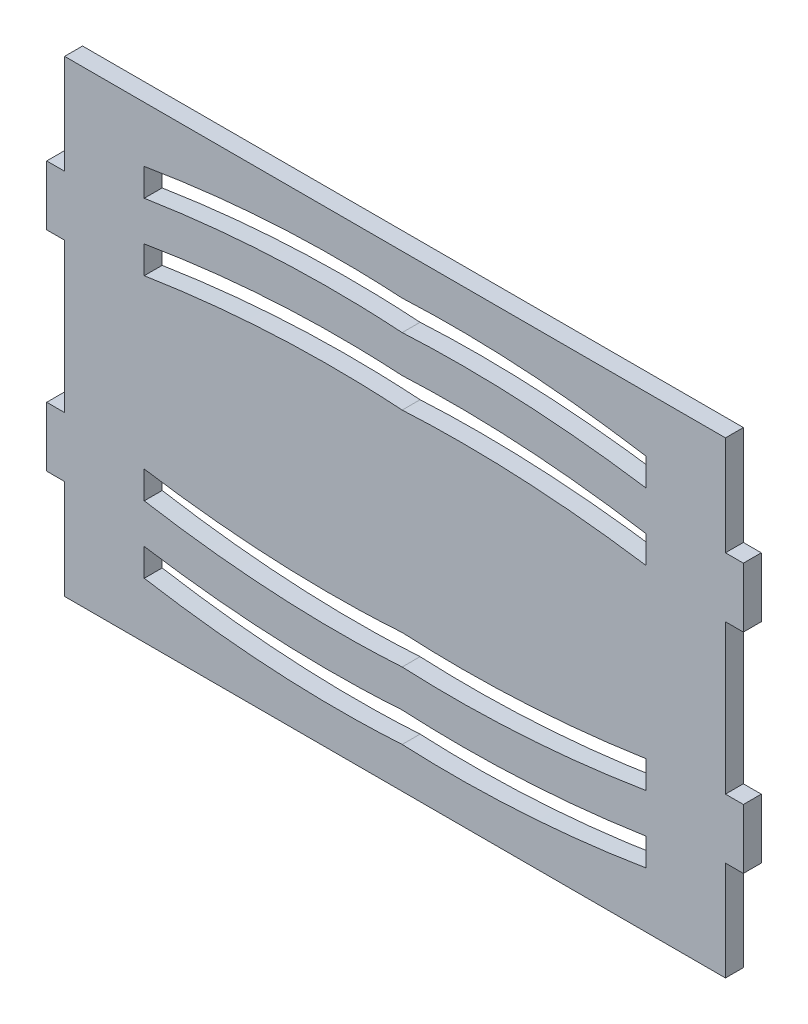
ISO-10303-21;
HEADER;
FILE_DESCRIPTION(('STEP AP214'),'2;1');
FILE_NAME('part.step','',(''),(''),'','','');
FILE_SCHEMA(('AUTOMOTIVE_DESIGN { 1 0 10303 214 1 1 1 1 }'));
ENDSEC;
DATA;
#1=APPLICATION_CONTEXT('core data for automotive mechanical design processes');
#2=APPLICATION_PROTOCOL_DEFINITION('international standard','automotive_design',2000,#1);
#3=PRODUCT_CONTEXT('',#1,'mechanical');
#4=PRODUCT('Part','Part','',(#3));
#5=PRODUCT_RELATED_PRODUCT_CATEGORY('part','',(#4));
#6=PRODUCT_DEFINITION_FORMATION('','',#4);
#7=PRODUCT_DEFINITION_CONTEXT('part definition',#1,'design');
#8=PRODUCT_DEFINITION('design','',#6,#7);
#9=PRODUCT_DEFINITION_SHAPE('','',#8);
#10=(LENGTH_UNIT() NAMED_UNIT(*) SI_UNIT(.MILLI.,.METRE.));
#11=(NAMED_UNIT(*) PLANE_ANGLE_UNIT() SI_UNIT($,.RADIAN.));
#12=(NAMED_UNIT(*) SI_UNIT($,.STERADIAN.) SOLID_ANGLE_UNIT());
#13=UNCERTAINTY_MEASURE_WITH_UNIT(LENGTH_MEASURE(1.E-05),#10,'distance_accuracy_value','');
#14=(GEOMETRIC_REPRESENTATION_CONTEXT(3) GLOBAL_UNCERTAINTY_ASSIGNED_CONTEXT((#13)) GLOBAL_UNIT_ASSIGNED_CONTEXT((#10,
#11,#12)) REPRESENTATION_CONTEXT('',''));
#15=CARTESIAN_POINT('',(0.,0.,0.));
#16=DIRECTION('',(0.,0.,1.));
#17=DIRECTION('',(1.,0.,0.));
#18=AXIS2_PLACEMENT_3D('',#15,#16,#17);
#19=CARTESIAN_POINT('',(0.,0.,18.));
#20=DIRECTION('',(0.,0.,1.));
#21=DIRECTION('',(1.,0.,0.));
#22=AXIS2_PLACEMENT_3D('',#19,#20,#21);
#23=PLANE('',#22);
#24=CARTESIAN_POINT('',(-252.,111.790004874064,18.));
#25=CARTESIAN_POINT('',(-118.018365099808,134.525959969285,18.));
#26=CARTESIAN_POINT('',(7.16093479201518,126.790004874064,18.));
#27=B_SPLINE_CURVE_WITH_KNOTS('',2,(#24,#25,#26),.UNSPECIFIED.,.F.,.F.,(3,3),(0.,
0.511095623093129),.UNSPECIFIED.);
#28=CARTESIAN_POINT('',(-252.,111.790004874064,18.));
#29=VERTEX_POINT('',#28);
#30=CARTESIAN_POINT('',(7.16093479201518,126.790004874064,18.));
#31=VERTEX_POINT('',#30);
#32=EDGE_CURVE('E777',#29,#31,#27,.T.);
#33=ORIENTED_EDGE('',*,*,#32,.T.);
#34=CARTESIAN_POINT('',(252.,111.790004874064,18.));
#35=CARTESIAN_POINT('',(125.388311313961,132.500069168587,18.));
#36=CARTESIAN_POINT('',(7.16093479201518,126.790004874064,18.));
#37=B_SPLINE_CURVE_WITH_KNOTS('',2,(#34,#35,#36),.UNSPECIFIED.,.F.,.F.,(3,3),(0.,
0.482354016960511),.UNSPECIFIED.);
#38=CARTESIAN_POINT('',(252.,111.790004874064,18.));
#39=VERTEX_POINT('',#38);
#40=EDGE_CURVE('E499',#39,#31,#37,.T.);
#41=ORIENTED_EDGE('',*,*,#40,.F.);
#42=DIRECTION('',(0.,-1.,0.));
#43=VECTOR('',#42,1.);
#44=CARTESIAN_POINT('',(252.,0.,18.));
#45=LINE('',#44,#43);
#46=CARTESIAN_POINT('',(252.,84.1066310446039,18.));
#47=VERTEX_POINT('',#46);
#48=EDGE_CURVE('E504',#39,#47,#45,.T.);
#49=ORIENTED_EDGE('',*,*,#48,.T.);
#50=CARTESIAN_POINT('',(252.,84.1066310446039,18.));
#51=CARTESIAN_POINT('',(125.34021268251,103.185118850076,18.));
#52=CARTESIAN_POINT('',(7.16093479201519,96.7900048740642,18.));
#53=B_SPLINE_CURVE_WITH_KNOTS('',2,(#50,#51,#52),.UNSPECIFIED.,.F.,.F.,(3,3),(0.,
0.482140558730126),.UNSPECIFIED.);
#54=CARTESIAN_POINT('',(7.16093479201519,96.7900048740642,18.));
#55=VERTEX_POINT('',#54);
#56=EDGE_CURVE('E788',#47,#55,#53,.T.);
#57=ORIENTED_EDGE('',*,*,#56,.T.);
#58=CARTESIAN_POINT('',(-252.,84.1066310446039,18.));
#59=CARTESIAN_POINT('',(-117.966189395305,105.194893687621,18.));
#60=CARTESIAN_POINT('',(7.16093479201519,96.7900048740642,18.));
#61=B_SPLINE_CURVE_WITH_KNOTS('',2,(#58,#59,#60),.UNSPECIFIED.,.F.,.F.,(3,3),(0.,
0.510888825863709),.UNSPECIFIED.);
#62=CARTESIAN_POINT('',(-252.,84.1066310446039,18.));
#63=VERTEX_POINT('',#62);
#64=EDGE_CURVE('E789',#63,#55,#61,.T.);
#65=ORIENTED_EDGE('',*,*,#64,.F.);
#66=DIRECTION('',(0.,-1.,0.));
#67=VECTOR('',#66,1.);
#68=CARTESIAN_POINT('',(-252.,0.,18.));
#69=LINE('',#68,#67);
#70=EDGE_CURVE('E791',#29,#63,#69,.T.);
#71=ORIENTED_EDGE('',*,*,#70,.F.);
#72=EDGE_LOOP('',(#33,#41,#49,#57,#65,#71));
#73=FACE_BOUND('',#72,.T.);
#74=DIRECTION('',(0.,1.,0.));
#75=VECTOR('',#74,1.);
#76=CARTESIAN_POINT('',(-252.,-111.790004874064,18.));
#77=LINE('',#76,#75);
#78=CARTESIAN_POINT('',(-252.,-111.790004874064,18.));
#79=VERTEX_POINT('',#78);
#80=CARTESIAN_POINT('',(-252.,-84.1066310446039,18.));
#81=VERTEX_POINT('',#80);
#82=EDGE_CURVE('E485',#79,#81,#77,.T.);
#83=ORIENTED_EDGE('',*,*,#82,.T.);
#84=CARTESIAN_POINT('',(-252.,-84.1066310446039,18.));
#85=CARTESIAN_POINT('',(-117.966189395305,-105.194893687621,18.));
#86=CARTESIAN_POINT('',(7.16093479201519,-96.7900048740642,18.));
#87=B_SPLINE_CURVE_WITH_KNOTS('',2,(#84,#85,#86),.UNSPECIFIED.,.F.,.F.,(3,3),(0.,
0.510888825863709),.UNSPECIFIED.);
#88=CARTESIAN_POINT('',(7.16093479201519,-96.7900048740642,18.));
#89=VERTEX_POINT('',#88);
#90=EDGE_CURVE('E532',#81,#89,#87,.T.);
#91=ORIENTED_EDGE('',*,*,#90,.T.);
#92=CARTESIAN_POINT('',(252.,-84.1066310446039,18.));
#93=CARTESIAN_POINT('',(125.34021268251,-103.185118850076,18.));
#94=CARTESIAN_POINT('',(7.16093479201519,-96.7900048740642,18.));
#95=B_SPLINE_CURVE_WITH_KNOTS('',2,(#92,#93,#94),.UNSPECIFIED.,.F.,.F.,(3,3),(0.,
0.482140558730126),.UNSPECIFIED.);
#96=CARTESIAN_POINT('',(252.,-84.1066310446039,18.));
#97=VERTEX_POINT('',#96);
#98=EDGE_CURVE('E538',#97,#89,#95,.T.);
#99=ORIENTED_EDGE('',*,*,#98,.F.);
#100=DIRECTION('',(0.,1.,0.));
#101=VECTOR('',#100,1.);
#102=CARTESIAN_POINT('',(252.,-111.790004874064,18.));
#103=LINE('',#102,#101);
#104=CARTESIAN_POINT('',(252.,-111.790004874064,18.));
#105=VERTEX_POINT('',#104);
#106=EDGE_CURVE('E1408',#105,#97,#103,.T.);
#107=ORIENTED_EDGE('',*,*,#106,.F.);
#108=CARTESIAN_POINT('',(252.,-111.790004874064,18.));
#109=CARTESIAN_POINT('',(125.388311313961,-132.500069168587,18.));
#110=CARTESIAN_POINT('',(7.16093479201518,-126.790004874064,18.));
#111=B_SPLINE_CURVE_WITH_KNOTS('',2,(#108,#109,#110),.UNSPECIFIED.,.F.,.F.,(3,3),(0.,
0.482354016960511),.UNSPECIFIED.);
#112=CARTESIAN_POINT('',(7.16093479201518,-126.790004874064,18.));
#113=VERTEX_POINT('',#112);
#114=EDGE_CURVE('E848',#105,#113,#111,.T.);
#115=ORIENTED_EDGE('',*,*,#114,.T.);
#116=CARTESIAN_POINT('',(-252.,-111.790004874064,18.));
#117=CARTESIAN_POINT('',(-118.018365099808,-134.525959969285,18.));
#118=CARTESIAN_POINT('',(7.16093479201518,-126.790004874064,18.));
#119=B_SPLINE_CURVE_WITH_KNOTS('',2,(#116,#117,#118),.UNSPECIFIED.,.F.,.F.,(3,3),(0.,
0.511095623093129),.UNSPECIFIED.);
#120=EDGE_CURVE('E827',#79,#113,#119,.T.);
#121=ORIENTED_EDGE('',*,*,#120,.F.);
#122=EDGE_LOOP('',(#83,#91,#99,#107,#115,#121));
#123=FACE_BOUND('',#122,.T.);
#124=DIRECTION('',(0.,1.,0.));
#125=VECTOR('',#124,1.);
#126=CARTESIAN_POINT('',(-252.,-179.190004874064,18.));
#127=LINE('',#126,#125);
#128=CARTESIAN_POINT('',(-252.,-179.190004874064,18.));
#129=VERTEX_POINT('',#128);
#130=CARTESIAN_POINT('',(-252.,-151.506631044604,18.));
#131=VERTEX_POINT('',#130);
#132=EDGE_CURVE('E843',#129,#131,#127,.T.);
#133=ORIENTED_EDGE('',*,*,#132,.T.);
#134=CARTESIAN_POINT('',(-252.,-151.506631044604,18.));
#135=CARTESIAN_POINT('',(-117.966189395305,-172.594893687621,18.));
#136=CARTESIAN_POINT('',(7.16093479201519,-164.190004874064,18.));
#137=B_SPLINE_CURVE_WITH_KNOTS('',2,(#134,#135,#136),.UNSPECIFIED.,.F.,.F.,(3,3),(0.,
0.510888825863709),.UNSPECIFIED.);
#138=CARTESIAN_POINT('',(7.16093479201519,-164.190004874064,18.));
#139=VERTEX_POINT('',#138);
#140=EDGE_CURVE('E870',#131,#139,#137,.T.);
#141=ORIENTED_EDGE('',*,*,#140,.T.);
#142=CARTESIAN_POINT('',(252.,-151.506631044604,18.));
#143=CARTESIAN_POINT('',(125.34021268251,-170.585118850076,18.));
#144=CARTESIAN_POINT('',(7.16093479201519,-164.190004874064,18.));
#145=B_SPLINE_CURVE_WITH_KNOTS('',2,(#142,#143,#144),.UNSPECIFIED.,.F.,.F.,(3,3),(0.,
0.482140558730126),.UNSPECIFIED.);
#146=CARTESIAN_POINT('',(252.,-151.506631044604,18.));
#147=VERTEX_POINT('',#146);
#148=EDGE_CURVE('E876',#147,#139,#145,.T.);
#149=ORIENTED_EDGE('',*,*,#148,.F.);
#150=DIRECTION('',(0.,1.,0.));
#151=VECTOR('',#150,1.);
#152=CARTESIAN_POINT('',(252.,-179.190004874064,18.));
#153=LINE('',#152,#151);
#154=CARTESIAN_POINT('',(252.,-179.190004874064,18.));
#155=VERTEX_POINT('',#154);
#156=EDGE_CURVE('E1391',#155,#147,#153,.T.);
#157=ORIENTED_EDGE('',*,*,#156,.F.);
#158=CARTESIAN_POINT('',(252.,-179.190004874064,18.));
#159=CARTESIAN_POINT('',(125.388311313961,-199.900069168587,18.));
#160=CARTESIAN_POINT('',(7.16093479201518,-194.190004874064,18.));
#161=B_SPLINE_CURVE_WITH_KNOTS('',2,(#158,#159,#160),.UNSPECIFIED.,.F.,.F.,(3,3),(0.,
0.482354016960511),.UNSPECIFIED.);
#162=CARTESIAN_POINT('',(7.16093479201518,-194.190004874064,18.));
#163=VERTEX_POINT('',#162);
#164=EDGE_CURVE('E569',#155,#163,#161,.T.);
#165=ORIENTED_EDGE('',*,*,#164,.T.);
#166=CARTESIAN_POINT('',(-252.,-179.190004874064,18.));
#167=CARTESIAN_POINT('',(-118.018365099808,-201.925959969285,18.));
#168=CARTESIAN_POINT('',(7.16093479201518,-194.190004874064,18.));
#169=B_SPLINE_CURVE_WITH_KNOTS('',2,(#166,#167,#168),.UNSPECIFIED.,.F.,.F.,(3,3),(0.,
0.511095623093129),.UNSPECIFIED.);
#170=EDGE_CURVE('E550',#129,#163,#169,.T.);
#171=ORIENTED_EDGE('',*,*,#170,.F.);
#172=EDGE_LOOP('',(#133,#141,#149,#157,#165,#171));
#173=FACE_BOUND('',#172,.T.);
#174=CARTESIAN_POINT('',(-252.,151.506631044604,18.));
#175=CARTESIAN_POINT('',(-117.966189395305,172.594893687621,18.));
#176=CARTESIAN_POINT('',(7.16093479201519,164.190004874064,18.));
#177=B_SPLINE_CURVE_WITH_KNOTS('',2,(#174,#175,#176),.UNSPECIFIED.,.F.,.F.,(3,3),(0.,
0.510888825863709),.UNSPECIFIED.);
#178=CARTESIAN_POINT('',(-252.,151.506631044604,18.));
#179=VERTEX_POINT('',#178);
#180=CARTESIAN_POINT('',(7.16093479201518,164.190004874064,18.));
#181=VERTEX_POINT('',#180);
#182=EDGE_CURVE('E886',#179,#181,#177,.T.);
#183=ORIENTED_EDGE('',*,*,#182,.F.);
#184=DIRECTION('',(0.,-1.,0.));
#185=VECTOR('',#184,1.);
#186=CARTESIAN_POINT('',(-252.,0.,18.));
#187=LINE('',#186,#185);
#188=CARTESIAN_POINT('',(-252.,179.190004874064,18.));
#189=VERTEX_POINT('',#188);
#190=EDGE_CURVE('E821',#189,#179,#187,.T.);
#191=ORIENTED_EDGE('',*,*,#190,.F.);
#192=CARTESIAN_POINT('',(-252.,179.190004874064,18.));
#193=CARTESIAN_POINT('',(-118.018365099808,201.925959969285,18.));
#194=CARTESIAN_POINT('',(7.16093479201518,194.190004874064,18.));
#195=B_SPLINE_CURVE_WITH_KNOTS('',2,(#192,#193,#194),.UNSPECIFIED.,.F.,.F.,(3,3),(0.,
0.511095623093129),.UNSPECIFIED.);
#196=CARTESIAN_POINT('',(7.16093479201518,194.190004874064,18.));
#197=VERTEX_POINT('',#196);
#198=EDGE_CURVE('E594',#189,#197,#195,.T.);
#199=ORIENTED_EDGE('',*,*,#198,.T.);
#200=CARTESIAN_POINT('',(252.,179.190004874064,18.));
#201=CARTESIAN_POINT('',(125.388311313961,199.900069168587,18.));
#202=CARTESIAN_POINT('',(7.16093479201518,194.190004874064,18.));
#203=B_SPLINE_CURVE_WITH_KNOTS('',2,(#200,#201,#202),.UNSPECIFIED.,.F.,.F.,(3,3),(0.,
0.482354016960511),.UNSPECIFIED.);
#204=CARTESIAN_POINT('',(252.,179.190004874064,18.));
#205=VERTEX_POINT('',#204);
#206=EDGE_CURVE('E601',#205,#197,#203,.T.);
#207=ORIENTED_EDGE('',*,*,#206,.F.);
#208=DIRECTION('',(0.,-1.,0.));
#209=VECTOR('',#208,1.);
#210=CARTESIAN_POINT('',(252.,0.,18.));
#211=LINE('',#210,#209);
#212=CARTESIAN_POINT('',(252.,151.506631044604,18.));
#213=VERTEX_POINT('',#212);
#214=EDGE_CURVE('E1376',#205,#213,#211,.T.);
#215=ORIENTED_EDGE('',*,*,#214,.T.);
#216=CARTESIAN_POINT('',(252.,151.506631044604,18.));
#217=CARTESIAN_POINT('',(125.34021268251,170.585118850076,18.));
#218=CARTESIAN_POINT('',(7.16093479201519,164.190004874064,18.));
#219=B_SPLINE_CURVE_WITH_KNOTS('',2,(#216,#217,#218),.UNSPECIFIED.,.F.,.F.,(3,3),(0.,
0.482140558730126),.UNSPECIFIED.);
#220=EDGE_CURVE('E891',#213,#181,#219,.T.);
#221=ORIENTED_EDGE('',*,*,#220,.T.);
#222=EDGE_LOOP('',(#183,#191,#199,#207,#215,#221));
#223=FACE_BOUND('',#222,.T.);
#224=DIRECTION('',(0.,-1.,0.));
#225=VECTOR('',#224,1.);
#226=CARTESIAN_POINT('',(332.,-1.22864681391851E-13,18.));
#227=LINE('',#226,#225);
#228=CARTESIAN_POINT('',(332.,74.9999999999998,18.));
#229=VERTEX_POINT('',#228);
#230=CARTESIAN_POINT('',(332.,-75.0000000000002,18.));
#231=VERTEX_POINT('',#230);
#232=EDGE_CURVE('E407',#229,#231,#227,.T.);
#233=ORIENTED_EDGE('',*,*,#232,.F.);
#234=DIRECTION('',(-1.,0.,0.));
#235=VECTOR('',#234,1.);
#236=CARTESIAN_POINT('',(0.,74.9999999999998,18.));
#237=LINE('',#236,#235);
#238=CARTESIAN_POINT('',(350.,74.9999999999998,18.));
#239=VERTEX_POINT('',#238);
#240=EDGE_CURVE('E400',#239,#229,#237,.T.);
#241=ORIENTED_EDGE('',*,*,#240,.F.);
#242=DIRECTION('',(0.,1.,0.));
#243=VECTOR('',#242,1.);
#244=CARTESIAN_POINT('',(350.,135.,18.));
#245=LINE('',#244,#243);
#246=CARTESIAN_POINT('',(350.,135.,18.));
#247=VERTEX_POINT('',#246);
#248=EDGE_CURVE('E355',#239,#247,#245,.T.);
#249=ORIENTED_EDGE('',*,*,#248,.T.);
#250=DIRECTION('',(-1.,0.,0.));
#251=VECTOR('',#250,1.);
#252=CARTESIAN_POINT('',(0.,135.,18.));
#253=LINE('',#252,#251);
#254=CARTESIAN_POINT('',(332.,135.,18.));
#255=VERTEX_POINT('',#254);
#256=EDGE_CURVE('E415',#247,#255,#253,.T.);
#257=ORIENTED_EDGE('',*,*,#256,.T.);
#258=DIRECTION('',(0.,1.,0.));
#259=VECTOR('',#258,1.);
#260=CARTESIAN_POINT('',(332.,0.,18.));
#261=LINE('',#260,#259);
#262=CARTESIAN_POINT('',(332.,235.,18.));
#263=VERTEX_POINT('',#262);
#264=EDGE_CURVE('E419',#255,#263,#261,.T.);
#265=ORIENTED_EDGE('',*,*,#264,.T.);
#266=DIRECTION('',(-1.,0.,0.));
#267=VECTOR('',#266,1.);
#268=CARTESIAN_POINT('',(342.,235.,18.));
#269=LINE('',#268,#267);
#270=CARTESIAN_POINT('',(-332.,235.,18.));
#271=VERTEX_POINT('',#270);
#272=EDGE_CURVE('E628',#263,#271,#269,.T.);
#273=ORIENTED_EDGE('',*,*,#272,.T.);
#274=DIRECTION('',(0.,1.,0.));
#275=VECTOR('',#274,1.);
#276=CARTESIAN_POINT('',(-332.,0.,18.));
#277=LINE('',#276,#275);
#278=CARTESIAN_POINT('',(-332.,135.,18.));
#279=VERTEX_POINT('',#278);
#280=EDGE_CURVE('E56',#279,#271,#277,.T.);
#281=ORIENTED_EDGE('',*,*,#280,.F.);
#282=DIRECTION('',(1.,0.,0.));
#283=VECTOR('',#282,1.);
#284=CARTESIAN_POINT('',(0.,135.,18.));
#285=LINE('',#284,#283);
#286=CARTESIAN_POINT('',(-350.,135.,18.));
#287=VERTEX_POINT('',#286);
#288=EDGE_CURVE('E434',#287,#279,#285,.T.);
#289=ORIENTED_EDGE('',*,*,#288,.F.);
#290=DIRECTION('',(0.,-1.,0.));
#291=VECTOR('',#290,1.);
#292=CARTESIAN_POINT('',(-350.,135.,18.));
#293=LINE('',#292,#291);
#294=CARTESIAN_POINT('',(-350.,75.,18.));
#295=VERTEX_POINT('',#294);
#296=EDGE_CURVE('E379',#287,#295,#293,.T.);
#297=ORIENTED_EDGE('',*,*,#296,.T.);
#298=DIRECTION('',(1.,0.,0.));
#299=VECTOR('',#298,1.);
#300=CARTESIAN_POINT('',(0.,75.,18.));
#301=LINE('',#300,#299);
#302=CARTESIAN_POINT('',(-332.,75.,18.));
#303=VERTEX_POINT('',#302);
#304=EDGE_CURVE('E460',#295,#303,#301,.T.);
#305=ORIENTED_EDGE('',*,*,#304,.T.);
#306=DIRECTION('',(0.,-1.,0.));
#307=VECTOR('',#306,1.);
#308=CARTESIAN_POINT('',(-332.,0.,18.));
#309=LINE('',#308,#307);
#310=CARTESIAN_POINT('',(-332.,-75.,18.));
#311=VERTEX_POINT('',#310);
#312=EDGE_CURVE('E455',#303,#311,#309,.T.);
#313=ORIENTED_EDGE('',*,*,#312,.T.);
#314=DIRECTION('',(1.,0.,0.));
#315=VECTOR('',#314,1.);
#316=CARTESIAN_POINT('',(0.,-75.,18.));
#317=LINE('',#316,#315);
#318=CARTESIAN_POINT('',(-350.,-75.,18.));
#319=VERTEX_POINT('',#318);
#320=EDGE_CURVE('E467',#319,#311,#317,.T.);
#321=ORIENTED_EDGE('',*,*,#320,.F.);
#322=DIRECTION('',(0.,-1.,0.));
#323=VECTOR('',#322,1.);
#324=CARTESIAN_POINT('',(-350.,-75.,18.));
#325=LINE('',#324,#323);
#326=CARTESIAN_POINT('',(-350.,-135.,18.));
#327=VERTEX_POINT('',#326);
#328=EDGE_CURVE('E367',#319,#327,#325,.T.);
#329=ORIENTED_EDGE('',*,*,#328,.T.);
#330=DIRECTION('',(-1.,0.,0.));
#331=VECTOR('',#330,1.);
#332=CARTESIAN_POINT('',(-332.,-135.,18.));
#333=LINE('',#332,#331);
#334=CARTESIAN_POINT('',(-332.,-135.,18.));
#335=VERTEX_POINT('',#334);
#336=EDGE_CURVE('E447',#335,#327,#333,.T.);
#337=ORIENTED_EDGE('',*,*,#336,.F.);
#338=DIRECTION('',(0.,-1.,0.));
#339=VECTOR('',#338,1.);
#340=CARTESIAN_POINT('',(-332.,-135.,18.));
#341=LINE('',#340,#339);
#342=CARTESIAN_POINT('',(-332.,-235.,18.));
#343=VERTEX_POINT('',#342);
#344=EDGE_CURVE('E444',#335,#343,#341,.T.);
#345=ORIENTED_EDGE('',*,*,#344,.T.);
#346=DIRECTION('',(1.,0.,0.));
#347=VECTOR('',#346,1.);
#348=CARTESIAN_POINT('',(342.,-235.,18.));
#349=LINE('',#348,#347);
#350=CARTESIAN_POINT('',(332.,-235.,18.));
#351=VERTEX_POINT('',#350);
#352=EDGE_CURVE('E626',#343,#351,#349,.T.);
#353=ORIENTED_EDGE('',*,*,#352,.T.);
#354=DIRECTION('',(0.,-1.,0.));
#355=VECTOR('',#354,1.);
#356=CARTESIAN_POINT('',(332.,0.,18.));
#357=LINE('',#356,#355);
#358=CARTESIAN_POINT('',(332.,-135.,18.));
#359=VERTEX_POINT('',#358);
#360=EDGE_CURVE('E331',#359,#351,#357,.T.);
#361=ORIENTED_EDGE('',*,*,#360,.F.);
#362=DIRECTION('',(-1.,0.,0.));
#363=VECTOR('',#362,1.);
#364=CARTESIAN_POINT('',(-3.74700270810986E-13,-134.999999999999,18.));
#365=LINE('',#364,#363);
#366=CARTESIAN_POINT('',(350.,-135.,18.));
#367=VERTEX_POINT('',#366);
#368=EDGE_CURVE('E323',#367,#359,#365,.T.);
#369=ORIENTED_EDGE('',*,*,#368,.F.);
#370=DIRECTION('',(0.,1.,0.));
#371=VECTOR('',#370,1.);
#372=CARTESIAN_POINT('',(350.,-75.0000000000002,18.));
#373=LINE('',#372,#371);
#374=CARTESIAN_POINT('',(350.,-75.0000000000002,18.));
#375=VERTEX_POINT('',#374);
#376=EDGE_CURVE('E328',#367,#375,#373,.T.);
#377=ORIENTED_EDGE('',*,*,#376,.T.);
#378=DIRECTION('',(-1.,0.,0.));
#379=VECTOR('',#378,1.);
#380=CARTESIAN_POINT('',(0.,-75.0000000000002,18.));
#381=LINE('',#380,#379);
#382=EDGE_CURVE('E395',#375,#231,#381,.T.);
#383=ORIENTED_EDGE('',*,*,#382,.T.);
#384=EDGE_LOOP('',(#233,#241,#249,#257,#265,#273,#281,#289,#297,#305,#313,#321,#329,#337,#345,
#353,#361,#369,#377,#383));
#385=FACE_BOUND('',#384,.T.);
#386=ADVANCED_FACE('F39',(#73,#123,#173,#223,#385),#23,.T.);
#387=CARTESIAN_POINT('',(0.,0.,0.));
#388=DIRECTION('',(0.,0.,1.));
#389=DIRECTION('',(1.,0.,0.));
#390=AXIS2_PLACEMENT_3D('',#387,#388,#389);
#391=PLANE('',#390);
#392=CARTESIAN_POINT('',(252.,111.790004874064,0.));
#393=CARTESIAN_POINT('',(125.388311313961,132.500069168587,0.));
#394=CARTESIAN_POINT('',(7.16093479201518,126.790004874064,0.));
#395=B_SPLINE_CURVE_WITH_KNOTS('',2,(#392,#393,#394),.UNSPECIFIED.,.F.,.F.,(3,3),(0.,
0.482354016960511),.UNSPECIFIED.);
#396=CARTESIAN_POINT('',(7.16093479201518,126.790004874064,0.));
#397=VERTEX_POINT('',#396);
#398=CARTESIAN_POINT('',(252.,111.790004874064,0.));
#399=VERTEX_POINT('',#398);
#400=EDGE_CURVE('E741',#397,#399,#395,.F.);
#401=ORIENTED_EDGE('',*,*,#400,.F.);
#402=CARTESIAN_POINT('',(-252.,111.790004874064,0.));
#403=CARTESIAN_POINT('',(-118.018365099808,134.525959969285,0.));
#404=CARTESIAN_POINT('',(7.16093479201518,126.790004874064,0.));
#405=B_SPLINE_CURVE_WITH_KNOTS('',2,(#402,#403,#404),.UNSPECIFIED.,.F.,.F.,(3,3),(0.,
0.511095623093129),.UNSPECIFIED.);
#406=CARTESIAN_POINT('',(-252.,111.790004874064,0.));
#407=VERTEX_POINT('',#406);
#408=EDGE_CURVE('E12',#397,#407,#405,.F.);
#409=ORIENTED_EDGE('',*,*,#408,.T.);
#410=DIRECTION('',(0.,1.,0.));
#411=VECTOR('',#410,1.);
#412=CARTESIAN_POINT('',(-252.,0.,0.));
#413=LINE('',#412,#411);
#414=CARTESIAN_POINT('',(-252.,84.1066310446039,0.));
#415=VERTEX_POINT('',#414);
#416=EDGE_CURVE('E49',#415,#407,#413,.T.);
#417=ORIENTED_EDGE('',*,*,#416,.F.);
#418=CARTESIAN_POINT('',(-252.,84.1066310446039,0.));
#419=CARTESIAN_POINT('',(-117.966189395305,105.194893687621,0.));
#420=CARTESIAN_POINT('',(7.16093479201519,96.7900048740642,0.));
#421=B_SPLINE_CURVE_WITH_KNOTS('',2,(#418,#419,#420),.UNSPECIFIED.,.F.,.F.,(3,3),(0.,
0.510888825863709),.UNSPECIFIED.);
#422=CARTESIAN_POINT('',(7.16093479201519,96.7900048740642,0.));
#423=VERTEX_POINT('',#422);
#424=EDGE_CURVE('E756',#423,#415,#421,.F.);
#425=ORIENTED_EDGE('',*,*,#424,.F.);
#426=CARTESIAN_POINT('',(252.,84.1066310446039,0.));
#427=CARTESIAN_POINT('',(125.34021268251,103.185118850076,0.));
#428=CARTESIAN_POINT('',(7.16093479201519,96.7900048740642,0.));
#429=B_SPLINE_CURVE_WITH_KNOTS('',2,(#426,#427,#428),.UNSPECIFIED.,.F.,.F.,(3,3),(0.,
0.482140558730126),.UNSPECIFIED.);
#430=CARTESIAN_POINT('',(252.,84.1066310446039,0.));
#431=VERTEX_POINT('',#430);
#432=EDGE_CURVE('E751',#423,#431,#429,.F.);
#433=ORIENTED_EDGE('',*,*,#432,.T.);
#434=DIRECTION('',(0.,1.,0.));
#435=VECTOR('',#434,1.);
#436=CARTESIAN_POINT('',(252.,0.,0.));
#437=LINE('',#436,#435);
#438=EDGE_CURVE('E745',#431,#399,#437,.T.);
#439=ORIENTED_EDGE('',*,*,#438,.T.);
#440=EDGE_LOOP('',(#401,#409,#417,#425,#433,#439));
#441=FACE_BOUND('',#440,.T.);
#442=CARTESIAN_POINT('',(-252.,-84.1066310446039,0.));
#443=CARTESIAN_POINT('',(-117.966189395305,-105.194893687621,0.));
#444=CARTESIAN_POINT('',(7.16093479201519,-96.7900048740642,0.));
#445=B_SPLINE_CURVE_WITH_KNOTS('',2,(#442,#443,#444),.UNSPECIFIED.,.F.,.F.,(3,3),(0.,
0.510888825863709),.UNSPECIFIED.);
#446=CARTESIAN_POINT('',(7.16093479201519,-96.7900048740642,0.));
#447=VERTEX_POINT('',#446);
#448=CARTESIAN_POINT('',(-252.,-84.1066310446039,0.));
#449=VERTEX_POINT('',#448);
#450=EDGE_CURVE('E706',#447,#449,#445,.F.);
#451=ORIENTED_EDGE('',*,*,#450,.T.);
#452=DIRECTION('',(0.,-1.,0.));
#453=VECTOR('',#452,1.);
#454=CARTESIAN_POINT('',(-252.,0.,0.));
#455=LINE('',#454,#453);
#456=CARTESIAN_POINT('',(-252.,-111.790004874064,0.));
#457=VERTEX_POINT('',#456);
#458=EDGE_CURVE('E735',#449,#457,#455,.T.);
#459=ORIENTED_EDGE('',*,*,#458,.T.);
#460=CARTESIAN_POINT('',(-252.,-111.790004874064,0.));
#461=CARTESIAN_POINT('',(-118.018365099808,-134.525959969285,0.));
#462=CARTESIAN_POINT('',(7.16093479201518,-126.790004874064,0.));
#463=B_SPLINE_CURVE_WITH_KNOTS('',2,(#460,#461,#462),.UNSPECIFIED.,.F.,.F.,(3,3),(0.,
0.511095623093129),.UNSPECIFIED.);
#464=CARTESIAN_POINT('',(7.16093479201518,-126.790004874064,0.));
#465=VERTEX_POINT('',#464);
#466=EDGE_CURVE('E728',#465,#457,#463,.F.);
#467=ORIENTED_EDGE('',*,*,#466,.F.);
#468=CARTESIAN_POINT('',(252.,-111.790004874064,0.));
#469=CARTESIAN_POINT('',(125.388311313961,-132.500069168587,0.));
#470=CARTESIAN_POINT('',(7.16093479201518,-126.790004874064,0.));
#471=B_SPLINE_CURVE_WITH_KNOTS('',2,(#468,#469,#470),.UNSPECIFIED.,.F.,.F.,(3,3),(0.,
0.482354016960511),.UNSPECIFIED.);
#472=CARTESIAN_POINT('',(252.,-111.790004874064,0.));
#473=VERTEX_POINT('',#472);
#474=EDGE_CURVE('E723',#465,#473,#471,.F.);
#475=ORIENTED_EDGE('',*,*,#474,.T.);
#476=DIRECTION('',(0.,-1.,0.));
#477=VECTOR('',#476,1.);
#478=CARTESIAN_POINT('',(252.,0.,0.));
#479=LINE('',#478,#477);
#480=CARTESIAN_POINT('',(252.,-84.1066310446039,0.));
#481=VERTEX_POINT('',#480);
#482=EDGE_CURVE('E718',#481,#473,#479,.T.);
#483=ORIENTED_EDGE('',*,*,#482,.F.);
#484=CARTESIAN_POINT('',(252.,-84.1066310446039,0.));
#485=CARTESIAN_POINT('',(125.34021268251,-103.185118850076,0.));
#486=CARTESIAN_POINT('',(7.16093479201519,-96.7900048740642,0.));
#487=B_SPLINE_CURVE_WITH_KNOTS('',2,(#484,#485,#486),.UNSPECIFIED.,.F.,.F.,(3,3),(0.,
0.482140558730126),.UNSPECIFIED.);
#488=EDGE_CURVE('E711',#447,#481,#487,.F.);
#489=ORIENTED_EDGE('',*,*,#488,.F.);
#490=EDGE_LOOP('',(#451,#459,#467,#475,#483,#489));
#491=FACE_BOUND('',#490,.T.);
#492=CARTESIAN_POINT('',(-252.,-151.506631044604,0.));
#493=CARTESIAN_POINT('',(-117.966189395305,-172.594893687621,0.));
#494=CARTESIAN_POINT('',(7.16093479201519,-164.190004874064,0.));
#495=B_SPLINE_CURVE_WITH_KNOTS('',2,(#492,#493,#494),.UNSPECIFIED.,.F.,.F.,(3,3),(0.,
0.510888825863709),.UNSPECIFIED.);
#496=CARTESIAN_POINT('',(7.16093479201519,-164.190004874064,0.));
#497=VERTEX_POINT('',#496);
#498=CARTESIAN_POINT('',(-252.,-151.506631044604,0.));
#499=VERTEX_POINT('',#498);
#500=EDGE_CURVE('E671',#497,#499,#495,.F.);
#501=ORIENTED_EDGE('',*,*,#500,.T.);
#502=DIRECTION('',(0.,-1.,0.));
#503=VECTOR('',#502,1.);
#504=CARTESIAN_POINT('',(-252.,0.,0.));
#505=LINE('',#504,#503);
#506=CARTESIAN_POINT('',(-252.,-179.190004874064,0.));
#507=VERTEX_POINT('',#506);
#508=EDGE_CURVE('E700',#499,#507,#505,.T.);
#509=ORIENTED_EDGE('',*,*,#508,.T.);
#510=CARTESIAN_POINT('',(-252.,-179.190004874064,0.));
#511=CARTESIAN_POINT('',(-118.018365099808,-201.925959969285,0.));
#512=CARTESIAN_POINT('',(7.16093479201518,-194.190004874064,0.));
#513=B_SPLINE_CURVE_WITH_KNOTS('',2,(#510,#511,#512),.UNSPECIFIED.,.F.,.F.,(3,3),(0.,
0.511095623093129),.UNSPECIFIED.);
#514=CARTESIAN_POINT('',(7.16093479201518,-194.190004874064,0.));
#515=VERTEX_POINT('',#514);
#516=EDGE_CURVE('E693',#515,#507,#513,.F.);
#517=ORIENTED_EDGE('',*,*,#516,.F.);
#518=CARTESIAN_POINT('',(252.,-179.190004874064,0.));
#519=CARTESIAN_POINT('',(125.388311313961,-199.900069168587,0.));
#520=CARTESIAN_POINT('',(7.16093479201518,-194.190004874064,0.));
#521=B_SPLINE_CURVE_WITH_KNOTS('',2,(#518,#519,#520),.UNSPECIFIED.,.F.,.F.,(3,3),(0.,
0.482354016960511),.UNSPECIFIED.);
#522=CARTESIAN_POINT('',(252.,-179.190004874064,0.));
#523=VERTEX_POINT('',#522);
#524=EDGE_CURVE('E688',#515,#523,#521,.F.);
#525=ORIENTED_EDGE('',*,*,#524,.T.);
#526=DIRECTION('',(0.,-1.,0.));
#527=VECTOR('',#526,1.);
#528=CARTESIAN_POINT('',(252.,0.,0.));
#529=LINE('',#528,#527);
#530=CARTESIAN_POINT('',(252.,-151.506631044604,0.));
#531=VERTEX_POINT('',#530);
#532=EDGE_CURVE('E683',#531,#523,#529,.T.);
#533=ORIENTED_EDGE('',*,*,#532,.F.);
#534=CARTESIAN_POINT('',(252.,-151.506631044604,0.));
#535=CARTESIAN_POINT('',(125.34021268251,-170.585118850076,0.));
#536=CARTESIAN_POINT('',(7.16093479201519,-164.190004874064,0.));
#537=B_SPLINE_CURVE_WITH_KNOTS('',2,(#534,#535,#536),.UNSPECIFIED.,.F.,.F.,(3,3),(0.,
0.482140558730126),.UNSPECIFIED.);
#538=EDGE_CURVE('E676',#497,#531,#537,.F.);
#539=ORIENTED_EDGE('',*,*,#538,.F.);
#540=EDGE_LOOP('',(#501,#509,#517,#525,#533,#539));
#541=FACE_BOUND('',#540,.T.);
#542=DIRECTION('',(0.,1.,0.));
#543=VECTOR('',#542,1.);
#544=CARTESIAN_POINT('',(-252.,0.,0.));
#545=LINE('',#544,#543);
#546=CARTESIAN_POINT('',(-252.,151.506631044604,0.));
#547=VERTEX_POINT('',#546);
#548=CARTESIAN_POINT('',(-252.,179.190004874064,0.));
#549=VERTEX_POINT('',#548);
#550=EDGE_CURVE('E665',#547,#549,#545,.T.);
#551=ORIENTED_EDGE('',*,*,#550,.F.);
#552=CARTESIAN_POINT('',(-252.,151.506631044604,0.));
#553=CARTESIAN_POINT('',(-117.966189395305,172.594893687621,0.));
#554=CARTESIAN_POINT('',(7.16093479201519,164.190004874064,0.));
#555=B_SPLINE_CURVE_WITH_KNOTS('',2,(#552,#553,#554),.UNSPECIFIED.,.F.,.F.,(3,3),(0.,
0.510888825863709),.UNSPECIFIED.);
#556=CARTESIAN_POINT('',(7.16093479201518,164.190004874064,0.));
#557=VERTEX_POINT('',#556);
#558=EDGE_CURVE('E658',#557,#547,#555,.F.);
#559=ORIENTED_EDGE('',*,*,#558,.F.);
#560=CARTESIAN_POINT('',(252.,151.506631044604,0.));
#561=CARTESIAN_POINT('',(125.34021268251,170.585118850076,0.));
#562=CARTESIAN_POINT('',(7.16093479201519,164.190004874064,0.));
#563=B_SPLINE_CURVE_WITH_KNOTS('',2,(#560,#561,#562),.UNSPECIFIED.,.F.,.F.,(3,3),(0.,
0.482140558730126),.UNSPECIFIED.);
#564=CARTESIAN_POINT('',(252.,151.506631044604,0.));
#565=VERTEX_POINT('',#564);
#566=EDGE_CURVE('E653',#557,#565,#563,.F.);
#567=ORIENTED_EDGE('',*,*,#566,.T.);
#568=DIRECTION('',(0.,1.,0.));
#569=VECTOR('',#568,1.);
#570=CARTESIAN_POINT('',(252.,0.,0.));
#571=LINE('',#570,#569);
#572=CARTESIAN_POINT('',(252.,179.190004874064,0.));
#573=VERTEX_POINT('',#572);
#574=EDGE_CURVE('E647',#565,#573,#571,.T.);
#575=ORIENTED_EDGE('',*,*,#574,.T.);
#576=CARTESIAN_POINT('',(252.,179.190004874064,0.));
#577=CARTESIAN_POINT('',(125.388311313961,199.900069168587,0.));
#578=CARTESIAN_POINT('',(7.16093479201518,194.190004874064,0.));
#579=B_SPLINE_CURVE_WITH_KNOTS('',2,(#576,#577,#578),.UNSPECIFIED.,.F.,.F.,(3,3),(0.,
0.482354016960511),.UNSPECIFIED.);
#580=CARTESIAN_POINT('',(7.16093479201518,194.190004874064,0.));
#581=VERTEX_POINT('',#580);
#582=EDGE_CURVE('E640',#581,#573,#579,.F.);
#583=ORIENTED_EDGE('',*,*,#582,.F.);
#584=CARTESIAN_POINT('',(-252.,179.190004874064,0.));
#585=CARTESIAN_POINT('',(-118.018365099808,201.925959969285,0.));
#586=CARTESIAN_POINT('',(7.16093479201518,194.190004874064,0.));
#587=B_SPLINE_CURVE_WITH_KNOTS('',2,(#584,#585,#586),.UNSPECIFIED.,.F.,.F.,(3,3),(0.,
0.511095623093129),.UNSPECIFIED.);
#588=EDGE_CURVE('E632',#581,#549,#587,.F.);
#589=ORIENTED_EDGE('',*,*,#588,.T.);
#590=EDGE_LOOP('',(#551,#559,#567,#575,#583,#589));
#591=FACE_BOUND('',#590,.T.);
#592=DIRECTION('',(-1.,0.,0.));
#593=VECTOR('',#592,1.);
#594=CARTESIAN_POINT('',(0.,74.9999999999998,0.));
#595=LINE('',#594,#593);
#596=CARTESIAN_POINT('',(350.,74.9999999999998,0.));
#597=VERTEX_POINT('',#596);
#598=CARTESIAN_POINT('',(332.,74.9999999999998,0.));
#599=VERTEX_POINT('',#598);
#600=EDGE_CURVE('E403',#597,#599,#595,.T.);
#601=ORIENTED_EDGE('',*,*,#600,.T.);
#602=DIRECTION('',(0.,-1.,0.));
#603=VECTOR('',#602,1.);
#604=CARTESIAN_POINT('',(332.,-1.22864681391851E-13,0.));
#605=LINE('',#604,#603);
#606=CARTESIAN_POINT('',(332.,-75.0000000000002,0.));
#607=VERTEX_POINT('',#606);
#608=EDGE_CURVE('E399',#599,#607,#605,.T.);
#609=ORIENTED_EDGE('',*,*,#608,.T.);
#610=DIRECTION('',(-1.,0.,0.));
#611=VECTOR('',#610,1.);
#612=CARTESIAN_POINT('',(0.,-75.0000000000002,0.));
#613=LINE('',#612,#611);
#614=CARTESIAN_POINT('',(350.,-75.0000000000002,0.));
#615=VERTEX_POINT('',#614);
#616=EDGE_CURVE('E396',#615,#607,#613,.T.);
#617=ORIENTED_EDGE('',*,*,#616,.F.);
#618=DIRECTION('',(0.,1.,0.));
#619=VECTOR('',#618,1.);
#620=CARTESIAN_POINT('',(350.,-75.0000000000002,0.));
#621=LINE('',#620,#619);
#622=CARTESIAN_POINT('',(350.,-135.,0.));
#623=VERTEX_POINT('',#622);
#624=EDGE_CURVE('E350',#623,#615,#621,.T.);
#625=ORIENTED_EDGE('',*,*,#624,.F.);
#626=DIRECTION('',(-1.,0.,0.));
#627=VECTOR('',#626,1.);
#628=CARTESIAN_POINT('',(-3.74700270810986E-13,-134.999999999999,0.));
#629=LINE('',#628,#627);
#630=CARTESIAN_POINT('',(332.,-135.,0.));
#631=VERTEX_POINT('',#630);
#632=EDGE_CURVE('E341',#623,#631,#629,.T.);
#633=ORIENTED_EDGE('',*,*,#632,.T.);
#634=DIRECTION('',(0.,-1.,0.));
#635=VECTOR('',#634,1.);
#636=CARTESIAN_POINT('',(332.,0.,0.));
#637=LINE('',#636,#635);
#638=CARTESIAN_POINT('',(332.,-235.,0.));
#639=VERTEX_POINT('',#638);
#640=EDGE_CURVE('E335',#631,#639,#637,.T.);
#641=ORIENTED_EDGE('',*,*,#640,.T.);
#642=DIRECTION('',(1.,0.,0.));
#643=VECTOR('',#642,1.);
#644=CARTESIAN_POINT('',(342.,-235.,0.));
#645=LINE('',#644,#643);
#646=CARTESIAN_POINT('',(-332.,-235.,0.));
#647=VERTEX_POINT('',#646);
#648=EDGE_CURVE('E625',#647,#639,#645,.T.);
#649=ORIENTED_EDGE('',*,*,#648,.F.);
#650=DIRECTION('',(0.,-1.,0.));
#651=VECTOR('',#650,1.);
#652=CARTESIAN_POINT('',(-332.,-135.,0.));
#653=LINE('',#652,#651);
#654=CARTESIAN_POINT('',(-332.,-135.,0.));
#655=VERTEX_POINT('',#654);
#656=EDGE_CURVE('E445',#655,#647,#653,.T.);
#657=ORIENTED_EDGE('',*,*,#656,.F.);
#658=DIRECTION('',(-1.,0.,0.));
#659=VECTOR('',#658,1.);
#660=CARTESIAN_POINT('',(-332.,-135.,0.));
#661=LINE('',#660,#659);
#662=CARTESIAN_POINT('',(-350.,-135.,0.));
#663=VERTEX_POINT('',#662);
#664=EDGE_CURVE('E428',#655,#663,#661,.T.);
#665=ORIENTED_EDGE('',*,*,#664,.T.);
#666=DIRECTION('',(0.,-1.,0.));
#667=VECTOR('',#666,1.);
#668=CARTESIAN_POINT('',(-350.,-75.,0.));
#669=LINE('',#668,#667);
#670=CARTESIAN_POINT('',(-350.,-75.,0.));
#671=VERTEX_POINT('',#670);
#672=EDGE_CURVE('E366',#671,#663,#669,.T.);
#673=ORIENTED_EDGE('',*,*,#672,.F.);
#674=DIRECTION('',(1.,0.,0.));
#675=VECTOR('',#674,1.);
#676=CARTESIAN_POINT('',(0.,-75.,0.));
#677=LINE('',#676,#675);
#678=CARTESIAN_POINT('',(-332.,-75.,0.));
#679=VERTEX_POINT('',#678);
#680=EDGE_CURVE('E459',#671,#679,#677,.T.);
#681=ORIENTED_EDGE('',*,*,#680,.T.);
#682=DIRECTION('',(0.,-1.,0.));
#683=VECTOR('',#682,1.);
#684=CARTESIAN_POINT('',(-332.,0.,0.));
#685=LINE('',#684,#683);
#686=CARTESIAN_POINT('',(-332.,75.,0.));
#687=VERTEX_POINT('',#686);
#688=EDGE_CURVE('E456',#687,#679,#685,.T.);
#689=ORIENTED_EDGE('',*,*,#688,.F.);
#690=DIRECTION('',(1.,0.,0.));
#691=VECTOR('',#690,1.);
#692=CARTESIAN_POINT('',(0.,75.,0.));
#693=LINE('',#692,#691);
#694=CARTESIAN_POINT('',(-350.,75.,0.));
#695=VERTEX_POINT('',#694);
#696=EDGE_CURVE('E413',#695,#687,#693,.T.);
#697=ORIENTED_EDGE('',*,*,#696,.F.);
#698=DIRECTION('',(0.,-1.,0.));
#699=VECTOR('',#698,1.);
#700=CARTESIAN_POINT('',(-350.,135.,0.));
#701=LINE('',#700,#699);
#702=CARTESIAN_POINT('',(-350.,135.,0.));
#703=VERTEX_POINT('',#702);
#704=EDGE_CURVE('E378',#703,#695,#701,.T.);
#705=ORIENTED_EDGE('',*,*,#704,.F.);
#706=DIRECTION('',(1.,0.,0.));
#707=VECTOR('',#706,1.);
#708=CARTESIAN_POINT('',(0.,135.,0.));
#709=LINE('',#708,#707);
#710=CARTESIAN_POINT('',(-332.,135.,0.));
#711=VERTEX_POINT('',#710);
#712=EDGE_CURVE('E433',#703,#711,#709,.T.);
#713=ORIENTED_EDGE('',*,*,#712,.T.);
#714=DIRECTION('',(0.,1.,0.));
#715=VECTOR('',#714,1.);
#716=CARTESIAN_POINT('',(-332.,0.,0.));
#717=LINE('',#716,#715);
#718=CARTESIAN_POINT('',(-332.,235.,0.));
#719=VERTEX_POINT('',#718);
#720=EDGE_CURVE('E430',#711,#719,#717,.T.);
#721=ORIENTED_EDGE('',*,*,#720,.T.);
#722=DIRECTION('',(-1.,0.,0.));
#723=VECTOR('',#722,1.);
#724=CARTESIAN_POINT('',(342.,235.,0.));
#725=LINE('',#724,#723);
#726=CARTESIAN_POINT('',(332.,235.,0.));
#727=VERTEX_POINT('',#726);
#728=EDGE_CURVE('E629',#727,#719,#725,.T.);
#729=ORIENTED_EDGE('',*,*,#728,.F.);
#730=DIRECTION('',(0.,1.,0.));
#731=VECTOR('',#730,1.);
#732=CARTESIAN_POINT('',(332.,0.,0.));
#733=LINE('',#732,#731);
#734=CARTESIAN_POINT('',(332.,135.,0.));
#735=VERTEX_POINT('',#734);
#736=EDGE_CURVE('E64',#735,#727,#733,.T.);
#737=ORIENTED_EDGE('',*,*,#736,.F.);
#738=DIRECTION('',(-1.,0.,0.));
#739=VECTOR('',#738,1.);
#740=CARTESIAN_POINT('',(0.,135.,0.));
#741=LINE('',#740,#739);
#742=CARTESIAN_POINT('',(350.,135.,0.));
#743=VERTEX_POINT('',#742);
#744=EDGE_CURVE('E416',#743,#735,#741,.T.);
#745=ORIENTED_EDGE('',*,*,#744,.F.);
#746=DIRECTION('',(0.,1.,0.));
#747=VECTOR('',#746,1.);
#748=CARTESIAN_POINT('',(350.,135.,0.));
#749=LINE('',#748,#747);
#750=EDGE_CURVE('E345',#597,#743,#749,.T.);
#751=ORIENTED_EDGE('',*,*,#750,.F.);
#752=EDGE_LOOP('',(#601,#609,#617,#625,#633,#641,#649,#657,#665,#673,#681,#689,#697,#705,#713,
#721,#729,#737,#745,#751));
#753=FACE_BOUND('',#752,.T.);
#754=ADVANCED_FACE('F779',(#441,#491,#541,#591,#753),#391,.F.);
#755=CARTESIAN_POINT('',(342.,235.,18.));
#756=DIRECTION('',(0.,-1.,0.));
#757=DIRECTION('',(1.,0.,0.));
#758=AXIS2_PLACEMENT_3D('',#755,#756,#757);
#759=PLANE('',#758);
#760=ORIENTED_EDGE('',*,*,#272,.F.);
#761=DIRECTION('',(0.,0.,-1.));
#762=VECTOR('',#761,1.);
#763=CARTESIAN_POINT('',(332.,235.,18.));
#764=LINE('',#763,#762);
#765=EDGE_CURVE('E412',#263,#727,#764,.T.);
#766=ORIENTED_EDGE('',*,*,#765,.T.);
#767=ORIENTED_EDGE('',*,*,#728,.T.);
#768=DIRECTION('',(0.,0.,-1.));
#769=VECTOR('',#768,1.);
#770=CARTESIAN_POINT('',(-332.,235.,18.));
#771=LINE('',#770,#769);
#772=EDGE_CURVE('E427',#271,#719,#771,.T.);
#773=ORIENTED_EDGE('',*,*,#772,.F.);
#774=EDGE_LOOP('',(#760,#766,#767,#773));
#775=FACE_BOUND('',#774,.T.);
#776=ADVANCED_FACE('F912',(#775),#759,.F.);
#777=CARTESIAN_POINT('',(342.,-235.,18.));
#778=DIRECTION('',(0.,1.,0.));
#779=DIRECTION('',(-1.,0.,0.));
#780=AXIS2_PLACEMENT_3D('',#777,#778,#779);
#781=PLANE('',#780);
#782=ORIENTED_EDGE('',*,*,#352,.F.);
#783=DIRECTION('',(0.,0.,-1.));
#784=VECTOR('',#783,1.);
#785=CARTESIAN_POINT('',(-332.,-235.,18.));
#786=LINE('',#785,#784);
#787=EDGE_CURVE('E390',#343,#647,#786,.T.);
#788=ORIENTED_EDGE('',*,*,#787,.T.);
#789=ORIENTED_EDGE('',*,*,#648,.T.);
#790=DIRECTION('',(0.,0.,-1.));
#791=VECTOR('',#790,1.);
#792=CARTESIAN_POINT('',(332.,-235.,18.));
#793=LINE('',#792,#791);
#794=EDGE_CURVE('E472',#351,#639,#793,.T.);
#795=ORIENTED_EDGE('',*,*,#794,.F.);
#796=EDGE_LOOP('',(#782,#788,#789,#795));
#797=FACE_BOUND('',#796,.T.);
#798=ADVANCED_FACE('F41',(#797),#781,.F.);
#799=CARTESIAN_POINT('',(-252.,0.,18.));
#800=DIRECTION('',(1.,0.,0.));
#801=DIRECTION('',(0.,0.,-1.));
#802=AXIS2_PLACEMENT_3D('',#799,#800,#801);
#803=PLANE('',#802);
#804=ORIENTED_EDGE('',*,*,#550,.T.);
#805=DIRECTION('',(0.,0.,-1.));
#806=VECTOR('',#805,1.);
#807=CARTESIAN_POINT('',(-252.,179.190004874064,18.));
#808=LINE('',#807,#806);
#809=EDGE_CURVE('E600',#189,#549,#808,.T.);
#810=ORIENTED_EDGE('',*,*,#809,.F.);
#811=ORIENTED_EDGE('',*,*,#190,.T.);
#812=DIRECTION('',(0.,0.,-1.));
#813=VECTOR('',#812,1.);
#814=CARTESIAN_POINT('',(-252.,151.506631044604,18.));
#815=LINE('',#814,#813);
#816=EDGE_CURVE('E622',#179,#547,#815,.T.);
#817=ORIENTED_EDGE('',*,*,#816,.T.);
#818=EDGE_LOOP('',(#804,#810,#811,#817));
#819=FACE_BOUND('',#818,.T.);
#820=ADVANCED_FACE('F904',(#819),#803,.T.);
#821=DIRECTION('',(0.,0.,-1.));
#822=VECTOR('',#821,1.);
#823=SURFACE_OF_LINEAR_EXTRUSION('',#177,#822);
#824=ORIENTED_EDGE('',*,*,#558,.T.);
#825=ORIENTED_EDGE('',*,*,#816,.F.);
#826=ORIENTED_EDGE('',*,*,#182,.T.);
#827=DIRECTION('',(0.,0.,-1.));
#828=VECTOR('',#827,1.);
#829=CARTESIAN_POINT('',(7.16093479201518,164.190004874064,18.));
#830=LINE('',#829,#828);
#831=EDGE_CURVE('E619',#181,#557,#830,.T.);
#832=ORIENTED_EDGE('',*,*,#831,.T.);
#833=EDGE_LOOP('',(#824,#825,#826,#832));
#834=FACE_BOUND('',#833,.T.);
#835=ADVANCED_FACE('F899',(#834),#823,.T.);
#836=DIRECTION('',(0.,0.,-1.));
#837=VECTOR('',#836,1.);
#838=SURFACE_OF_LINEAR_EXTRUSION('',#219,#837);
#839=ORIENTED_EDGE('',*,*,#831,.F.);
#840=ORIENTED_EDGE('',*,*,#220,.F.);
#841=DIRECTION('',(0.,0.,-1.));
#842=VECTOR('',#841,1.);
#843=CARTESIAN_POINT('',(252.,151.506631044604,18.));
#844=LINE('',#843,#842);
#845=EDGE_CURVE('E616',#213,#565,#844,.T.);
#846=ORIENTED_EDGE('',*,*,#845,.T.);
#847=ORIENTED_EDGE('',*,*,#566,.F.);
#848=EDGE_LOOP('',(#839,#840,#846,#847));
#849=FACE_BOUND('',#848,.T.);
#850=ADVANCED_FACE('F903',(#849),#838,.F.);
#851=CARTESIAN_POINT('',(252.,0.,18.));
#852=DIRECTION('',(1.,0.,0.));
#853=DIRECTION('',(0.,0.,-1.));
#854=AXIS2_PLACEMENT_3D('',#851,#852,#853);
#855=PLANE('',#854);
#856=ORIENTED_EDGE('',*,*,#845,.F.);
#857=ORIENTED_EDGE('',*,*,#214,.F.);
#858=DIRECTION('',(0.,0.,-1.));
#859=VECTOR('',#858,1.);
#860=CARTESIAN_POINT('',(252.,179.190004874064,18.));
#861=LINE('',#860,#859);
#862=EDGE_CURVE('E613',#205,#573,#861,.T.);
#863=ORIENTED_EDGE('',*,*,#862,.T.);
#864=ORIENTED_EDGE('',*,*,#574,.F.);
#865=EDGE_LOOP('',(#856,#857,#863,#864));
#866=FACE_BOUND('',#865,.T.);
#867=ADVANCED_FACE('F1118',(#866),#855,.F.);
#868=DIRECTION('',(0.,0.,-1.));
#869=VECTOR('',#868,1.);
#870=SURFACE_OF_LINEAR_EXTRUSION('',#203,#869);
#871=ORIENTED_EDGE('',*,*,#582,.T.);
#872=ORIENTED_EDGE('',*,*,#862,.F.);
#873=ORIENTED_EDGE('',*,*,#206,.T.);
#874=DIRECTION('',(0.,0.,-1.));
#875=VECTOR('',#874,1.);
#876=CARTESIAN_POINT('',(7.16093479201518,194.190004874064,18.));
#877=LINE('',#876,#875);
#878=EDGE_CURVE('E610',#197,#581,#877,.T.);
#879=ORIENTED_EDGE('',*,*,#878,.T.);
#880=EDGE_LOOP('',(#871,#872,#873,#879));
#881=FACE_BOUND('',#880,.T.);
#882=ADVANCED_FACE('F590',(#881),#870,.T.);
#883=DIRECTION('',(0.,0.,-1.));
#884=VECTOR('',#883,1.);
#885=SURFACE_OF_LINEAR_EXTRUSION('',#195,#884);
#886=ORIENTED_EDGE('',*,*,#878,.F.);
#887=ORIENTED_EDGE('',*,*,#198,.F.);
#888=ORIENTED_EDGE('',*,*,#809,.T.);
#889=ORIENTED_EDGE('',*,*,#588,.F.);
#890=EDGE_LOOP('',(#886,#887,#888,#889));
#891=FACE_BOUND('',#890,.T.);
#892=ADVANCED_FACE('F586',(#891),#885,.F.);
#893=CARTESIAN_POINT('',(-252.,-179.190004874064,18.));
#894=DIRECTION('',(-1.,0.,0.));
#895=DIRECTION('',(0.,0.,1.));
#896=AXIS2_PLACEMENT_3D('',#893,#894,#895);
#897=PLANE('',#896);
#898=DIRECTION('',(0.,0.,-1.));
#899=VECTOR('',#898,1.);
#900=CARTESIAN_POINT('',(-252.,-151.506631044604,18.));
#901=LINE('',#900,#899);
#902=EDGE_CURVE('E548',#131,#499,#901,.T.);
#903=ORIENTED_EDGE('',*,*,#902,.F.);
#904=ORIENTED_EDGE('',*,*,#132,.F.);
#905=DIRECTION('',(0.,0.,-1.));
#906=VECTOR('',#905,1.);
#907=CARTESIAN_POINT('',(-252.,-179.190004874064,18.));
#908=LINE('',#907,#906);
#909=EDGE_CURVE('E480',#129,#507,#908,.T.);
#910=ORIENTED_EDGE('',*,*,#909,.T.);
#911=ORIENTED_EDGE('',*,*,#508,.F.);
#912=EDGE_LOOP('',(#903,#904,#910,#911));
#913=FACE_BOUND('',#912,.T.);
#914=ADVANCED_FACE('F583',(#913),#897,.F.);
#915=DIRECTION('',(0.,0.,-1.));
#916=VECTOR('',#915,1.);
#917=SURFACE_OF_LINEAR_EXTRUSION('',#169,#916);
#918=ORIENTED_EDGE('',*,*,#516,.T.);
#919=ORIENTED_EDGE('',*,*,#909,.F.);
#920=ORIENTED_EDGE('',*,*,#170,.T.);
#921=DIRECTION('',(0.,0.,-1.));
#922=VECTOR('',#921,1.);
#923=CARTESIAN_POINT('',(7.16093479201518,-194.190004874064,18.));
#924=LINE('',#923,#922);
#925=EDGE_CURVE('E560',#163,#515,#924,.T.);
#926=ORIENTED_EDGE('',*,*,#925,.T.);
#927=EDGE_LOOP('',(#918,#919,#920,#926));
#928=FACE_BOUND('',#927,.T.);
#929=ADVANCED_FACE('F578',(#928),#917,.T.);
#930=DIRECTION('',(0.,0.,-1.));
#931=VECTOR('',#930,1.);
#932=SURFACE_OF_LINEAR_EXTRUSION('',#161,#931);
#933=ORIENTED_EDGE('',*,*,#925,.F.);
#934=ORIENTED_EDGE('',*,*,#164,.F.);
#935=DIRECTION('',(0.,0.,-1.));
#936=VECTOR('',#935,1.);
#937=CARTESIAN_POINT('',(252.,-179.190004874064,18.));
#938=LINE('',#937,#936);
#939=EDGE_CURVE('E557',#155,#523,#938,.T.);
#940=ORIENTED_EDGE('',*,*,#939,.T.);
#941=ORIENTED_EDGE('',*,*,#524,.F.);
#942=EDGE_LOOP('',(#933,#934,#940,#941));
#943=FACE_BOUND('',#942,.T.);
#944=ADVANCED_FACE('F582',(#943),#932,.F.);
#945=CARTESIAN_POINT('',(252.,-179.190004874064,18.));
#946=DIRECTION('',(-1.,0.,0.));
#947=DIRECTION('',(0.,0.,1.));
#948=AXIS2_PLACEMENT_3D('',#945,#946,#947);
#949=PLANE('',#948);
#950=ORIENTED_EDGE('',*,*,#532,.T.);
#951=ORIENTED_EDGE('',*,*,#939,.F.);
#952=ORIENTED_EDGE('',*,*,#156,.T.);
#953=DIRECTION('',(0.,0.,-1.));
#954=VECTOR('',#953,1.);
#955=CARTESIAN_POINT('',(252.,-151.506631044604,18.));
#956=LINE('',#955,#954);
#957=EDGE_CURVE('E554',#147,#531,#956,.T.);
#958=ORIENTED_EDGE('',*,*,#957,.T.);
#959=EDGE_LOOP('',(#950,#951,#952,#958));
#960=FACE_BOUND('',#959,.T.);
#961=ADVANCED_FACE('F1087',(#960),#949,.T.);
#962=DIRECTION('',(0.,0.,-1.));
#963=VECTOR('',#962,1.);
#964=SURFACE_OF_LINEAR_EXTRUSION('',#145,#963);
#965=ORIENTED_EDGE('',*,*,#538,.T.);
#966=ORIENTED_EDGE('',*,*,#957,.F.);
#967=ORIENTED_EDGE('',*,*,#148,.T.);
#968=DIRECTION('',(0.,0.,-1.));
#969=VECTOR('',#968,1.);
#970=CARTESIAN_POINT('',(7.16093479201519,-164.190004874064,18.));
#971=LINE('',#970,#969);
#972=EDGE_CURVE('E551',#139,#497,#971,.T.);
#973=ORIENTED_EDGE('',*,*,#972,.T.);
#974=EDGE_LOOP('',(#965,#966,#967,#973));
#975=FACE_BOUND('',#974,.T.);
#976=ADVANCED_FACE('F867',(#975),#964,.T.);
#977=DIRECTION('',(0.,0.,-1.));
#978=VECTOR('',#977,1.);
#979=SURFACE_OF_LINEAR_EXTRUSION('',#137,#978);
#980=ORIENTED_EDGE('',*,*,#972,.F.);
#981=ORIENTED_EDGE('',*,*,#140,.F.);
#982=ORIENTED_EDGE('',*,*,#902,.T.);
#983=ORIENTED_EDGE('',*,*,#500,.F.);
#984=EDGE_LOOP('',(#980,#981,#982,#983));
#985=FACE_BOUND('',#984,.T.);
#986=ADVANCED_FACE('F521',(#985),#979,.F.);
#987=CARTESIAN_POINT('',(-252.,-111.790004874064,18.));
#988=DIRECTION('',(-1.,0.,0.));
#989=DIRECTION('',(0.,0.,1.));
#990=AXIS2_PLACEMENT_3D('',#987,#988,#989);
#991=PLANE('',#990);
#992=DIRECTION('',(0.,0.,-1.));
#993=VECTOR('',#992,1.);
#994=CARTESIAN_POINT('',(-252.,-84.1066310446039,18.));
#995=LINE('',#994,#993);
#996=EDGE_CURVE('E822',#81,#449,#995,.T.);
#997=ORIENTED_EDGE('',*,*,#996,.F.);
#998=ORIENTED_EDGE('',*,*,#82,.F.);
#999=DIRECTION('',(0.,0.,-1.));
#1000=VECTOR('',#999,1.);
#1001=CARTESIAN_POINT('',(-252.,-111.790004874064,18.));
#1002=LINE('',#1001,#1000);
#1003=EDGE_CURVE('E840',#79,#457,#1002,.T.);
#1004=ORIENTED_EDGE('',*,*,#1003,.T.);
#1005=ORIENTED_EDGE('',*,*,#458,.F.);
#1006=EDGE_LOOP('',(#997,#998,#1004,#1005));
#1007=FACE_BOUND('',#1006,.T.);
#1008=ADVANCED_FACE('F517',(#1007),#991,.F.);
#1009=DIRECTION('',(0.,0.,-1.));
#1010=VECTOR('',#1009,1.);
#1011=SURFACE_OF_LINEAR_EXTRUSION('',#119,#1010);
#1012=ORIENTED_EDGE('',*,*,#466,.T.);
#1013=ORIENTED_EDGE('',*,*,#1003,.F.);
#1014=ORIENTED_EDGE('',*,*,#120,.T.);
#1015=DIRECTION('',(0.,0.,-1.));
#1016=VECTOR('',#1015,1.);
#1017=CARTESIAN_POINT('',(7.16093479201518,-126.790004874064,18.));
#1018=LINE('',#1017,#1016);
#1019=EDGE_CURVE('E837',#113,#465,#1018,.T.);
#1020=ORIENTED_EDGE('',*,*,#1019,.T.);
#1021=EDGE_LOOP('',(#1012,#1013,#1014,#1020));
#1022=FACE_BOUND('',#1021,.T.);
#1023=ADVANCED_FACE('F520',(#1022),#1011,.T.);
#1024=DIRECTION('',(0.,0.,-1.));
#1025=VECTOR('',#1024,1.);
#1026=SURFACE_OF_LINEAR_EXTRUSION('',#111,#1025);
#1027=ORIENTED_EDGE('',*,*,#1019,.F.);
#1028=ORIENTED_EDGE('',*,*,#114,.F.);
#1029=DIRECTION('',(0.,0.,-1.));
#1030=VECTOR('',#1029,1.);
#1031=CARTESIAN_POINT('',(252.,-111.790004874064,18.));
#1032=LINE('',#1031,#1030);
#1033=EDGE_CURVE('E834',#105,#473,#1032,.T.);
#1034=ORIENTED_EDGE('',*,*,#1033,.T.);
#1035=ORIENTED_EDGE('',*,*,#474,.F.);
#1036=EDGE_LOOP('',(#1027,#1028,#1034,#1035));
#1037=FACE_BOUND('',#1036,.T.);
#1038=ADVANCED_FACE('F859',(#1037),#1026,.F.);
#1039=CARTESIAN_POINT('',(252.,-111.790004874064,18.));
#1040=DIRECTION('',(-1.,0.,0.));
#1041=DIRECTION('',(0.,0.,1.));
#1042=AXIS2_PLACEMENT_3D('',#1039,#1040,#1041);
#1043=PLANE('',#1042);
#1044=ORIENTED_EDGE('',*,*,#482,.T.);
#1045=ORIENTED_EDGE('',*,*,#1033,.F.);
#1046=ORIENTED_EDGE('',*,*,#106,.T.);
#1047=DIRECTION('',(0.,0.,-1.));
#1048=VECTOR('',#1047,1.);
#1049=CARTESIAN_POINT('',(252.,-84.1066310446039,18.));
#1050=LINE('',#1049,#1048);
#1051=EDGE_CURVE('E831',#97,#481,#1050,.T.);
#1052=ORIENTED_EDGE('',*,*,#1051,.T.);
#1053=EDGE_LOOP('',(#1044,#1045,#1046,#1052));
#1054=FACE_BOUND('',#1053,.T.);
#1055=ADVANCED_FACE('F1056',(#1054),#1043,.T.);
#1056=DIRECTION('',(0.,0.,-1.));
#1057=VECTOR('',#1056,1.);
#1058=SURFACE_OF_LINEAR_EXTRUSION('',#95,#1057);
#1059=ORIENTED_EDGE('',*,*,#488,.T.);
#1060=ORIENTED_EDGE('',*,*,#1051,.F.);
#1061=ORIENTED_EDGE('',*,*,#98,.T.);
#1062=DIRECTION('',(0.,0.,-1.));
#1063=VECTOR('',#1062,1.);
#1064=CARTESIAN_POINT('',(7.16093479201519,-96.7900048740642,18.));
#1065=LINE('',#1064,#1063);
#1066=EDGE_CURVE('E828',#89,#447,#1065,.T.);
#1067=ORIENTED_EDGE('',*,*,#1066,.T.);
#1068=EDGE_LOOP('',(#1059,#1060,#1061,#1067));
#1069=FACE_BOUND('',#1068,.T.);
#1070=ADVANCED_FACE('F528',(#1069),#1058,.T.);
#1071=DIRECTION('',(0.,0.,-1.));
#1072=VECTOR('',#1071,1.);
#1073=SURFACE_OF_LINEAR_EXTRUSION('',#87,#1072);
#1074=ORIENTED_EDGE('',*,*,#1066,.F.);
#1075=ORIENTED_EDGE('',*,*,#90,.F.);
#1076=ORIENTED_EDGE('',*,*,#996,.T.);
#1077=ORIENTED_EDGE('',*,*,#450,.F.);
#1078=EDGE_LOOP('',(#1074,#1075,#1076,#1077));
#1079=FACE_BOUND('',#1078,.T.);
#1080=ADVANCED_FACE('F523',(#1079),#1073,.F.);
#1081=DIRECTION('',(0.,0.,-1.));
#1082=VECTOR('',#1081,1.);
#1083=SURFACE_OF_LINEAR_EXTRUSION('',#27,#1082);
#1084=DIRECTION('',(0.,0.,-1.));
#1085=VECTOR('',#1084,1.);
#1086=CARTESIAN_POINT('',(7.16093479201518,126.790004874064,18.));
#1087=LINE('',#1086,#1085);
#1088=EDGE_CURVE('E497',#31,#397,#1087,.T.);
#1089=ORIENTED_EDGE('',*,*,#1088,.F.);
#1090=ORIENTED_EDGE('',*,*,#32,.F.);
#1091=DIRECTION('',(0.,0.,-1.));
#1092=VECTOR('',#1091,1.);
#1093=CARTESIAN_POINT('',(-252.,111.790004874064,18.));
#1094=LINE('',#1093,#1092);
#1095=EDGE_CURVE('E481',#29,#407,#1094,.T.);
#1096=ORIENTED_EDGE('',*,*,#1095,.T.);
#1097=ORIENTED_EDGE('',*,*,#408,.F.);
#1098=EDGE_LOOP('',(#1089,#1090,#1096,#1097));
#1099=FACE_BOUND('',#1098,.T.);
#1100=ADVANCED_FACE('F527',(#1099),#1083,.F.);
#1101=CARTESIAN_POINT('',(-252.,0.,18.));
#1102=DIRECTION('',(1.,0.,0.));
#1103=DIRECTION('',(0.,0.,-1.));
#1104=AXIS2_PLACEMENT_3D('',#1101,#1102,#1103);
#1105=PLANE('',#1104);
#1106=ORIENTED_EDGE('',*,*,#416,.T.);
#1107=ORIENTED_EDGE('',*,*,#1095,.F.);
#1108=ORIENTED_EDGE('',*,*,#70,.T.);
#1109=DIRECTION('',(0.,0.,-1.));
#1110=VECTOR('',#1109,1.);
#1111=CARTESIAN_POINT('',(-252.,84.1066310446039,18.));
#1112=LINE('',#1111,#1110);
#1113=EDGE_CURVE('E484',#63,#415,#1112,.T.);
#1114=ORIENTED_EDGE('',*,*,#1113,.T.);
#1115=EDGE_LOOP('',(#1106,#1107,#1108,#1114));
#1116=FACE_BOUND('',#1115,.T.);
#1117=ADVANCED_FACE('F767',(#1116),#1105,.T.);
#1118=DIRECTION('',(0.,0.,-1.));
#1119=VECTOR('',#1118,1.);
#1120=SURFACE_OF_LINEAR_EXTRUSION('',#61,#1119);
#1121=ORIENTED_EDGE('',*,*,#424,.T.);
#1122=ORIENTED_EDGE('',*,*,#1113,.F.);
#1123=ORIENTED_EDGE('',*,*,#64,.T.);
#1124=DIRECTION('',(0.,0.,-1.));
#1125=VECTOR('',#1124,1.);
#1126=CARTESIAN_POINT('',(7.16093479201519,96.7900048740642,18.));
#1127=LINE('',#1126,#1125);
#1128=EDGE_CURVE('E488',#55,#423,#1127,.T.);
#1129=ORIENTED_EDGE('',*,*,#1128,.T.);
#1130=EDGE_LOOP('',(#1121,#1122,#1123,#1129));
#1131=FACE_BOUND('',#1130,.T.);
#1132=ADVANCED_FACE('F806',(#1131),#1120,.T.);
#1133=DIRECTION('',(0.,0.,-1.));
#1134=VECTOR('',#1133,1.);
#1135=SURFACE_OF_LINEAR_EXTRUSION('',#53,#1134);
#1136=ORIENTED_EDGE('',*,*,#1128,.F.);
#1137=ORIENTED_EDGE('',*,*,#56,.F.);
#1138=DIRECTION('',(0.,0.,-1.));
#1139=VECTOR('',#1138,1.);
#1140=CARTESIAN_POINT('',(252.,84.1066310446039,18.));
#1141=LINE('',#1140,#1139);
#1142=EDGE_CURVE('E491',#47,#431,#1141,.T.);
#1143=ORIENTED_EDGE('',*,*,#1142,.T.);
#1144=ORIENTED_EDGE('',*,*,#432,.F.);
#1145=EDGE_LOOP('',(#1136,#1137,#1143,#1144));
#1146=FACE_BOUND('',#1145,.T.);
#1147=ADVANCED_FACE('F803',(#1146),#1135,.F.);
#1148=CARTESIAN_POINT('',(252.,0.,18.));
#1149=DIRECTION('',(1.,0.,0.));
#1150=DIRECTION('',(0.,0.,-1.));
#1151=AXIS2_PLACEMENT_3D('',#1148,#1149,#1150);
#1152=PLANE('',#1151);
#1153=ORIENTED_EDGE('',*,*,#1142,.F.);
#1154=ORIENTED_EDGE('',*,*,#48,.F.);
#1155=DIRECTION('',(0.,0.,-1.));
#1156=VECTOR('',#1155,1.);
#1157=CARTESIAN_POINT('',(252.,111.790004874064,18.));
#1158=LINE('',#1157,#1156);
#1159=EDGE_CURVE('E494',#39,#399,#1158,.T.);
#1160=ORIENTED_EDGE('',*,*,#1159,.T.);
#1161=ORIENTED_EDGE('',*,*,#438,.F.);
#1162=EDGE_LOOP('',(#1153,#1154,#1160,#1161));
#1163=FACE_BOUND('',#1162,.T.);
#1164=ADVANCED_FACE('F514',(#1163),#1152,.F.);
#1165=DIRECTION('',(0.,0.,-1.));
#1166=VECTOR('',#1165,1.);
#1167=SURFACE_OF_LINEAR_EXTRUSION('',#37,#1166);
#1168=ORIENTED_EDGE('',*,*,#400,.T.);
#1169=ORIENTED_EDGE('',*,*,#1159,.F.);
#1170=ORIENTED_EDGE('',*,*,#40,.T.);
#1171=ORIENTED_EDGE('',*,*,#1088,.T.);
#1172=EDGE_LOOP('',(#1168,#1169,#1170,#1171));
#1173=FACE_BOUND('',#1172,.T.);
#1174=ADVANCED_FACE('F510',(#1173),#1167,.T.);
#1175=CARTESIAN_POINT('',(-3.74700270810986E-13,-134.999999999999,18.));
#1176=DIRECTION('',(0.,-1.,0.));
#1177=DIRECTION('',(1.,0.,0.));
#1178=AXIS2_PLACEMENT_3D('',#1175,#1176,#1177);
#1179=PLANE('',#1178);
#1180=ORIENTED_EDGE('',*,*,#632,.F.);
#1181=DIRECTION('',(0.,0.,-1.));
#1182=VECTOR('',#1181,1.);
#1183=CARTESIAN_POINT('',(350.,-135.,18.));
#1184=LINE('',#1183,#1182);
#1185=EDGE_CURVE('E338',#367,#623,#1184,.T.);
#1186=ORIENTED_EDGE('',*,*,#1185,.F.);
#1187=ORIENTED_EDGE('',*,*,#368,.T.);
#1188=DIRECTION('',(0.,0.,-1.));
#1189=VECTOR('',#1188,1.);
#1190=CARTESIAN_POINT('',(332.,-135.,18.));
#1191=LINE('',#1190,#1189);
#1192=EDGE_CURVE('E478',#359,#631,#1191,.T.);
#1193=ORIENTED_EDGE('',*,*,#1192,.T.);
#1194=EDGE_LOOP('',(#1180,#1186,#1187,#1193));
#1195=FACE_BOUND('',#1194,.T.);
#1196=ADVANCED_FACE('F339',(#1195),#1179,.T.);
#1197=CARTESIAN_POINT('',(332.,0.,18.));
#1198=DIRECTION('',(1.,0.,0.));
#1199=DIRECTION('',(0.,0.,-1.));
#1200=AXIS2_PLACEMENT_3D('',#1197,#1198,#1199);
#1201=PLANE('',#1200);
#1202=ORIENTED_EDGE('',*,*,#640,.F.);
#1203=ORIENTED_EDGE('',*,*,#1192,.F.);
#1204=ORIENTED_EDGE('',*,*,#360,.T.);
#1205=ORIENTED_EDGE('',*,*,#794,.T.);
#1206=EDGE_LOOP('',(#1202,#1203,#1204,#1205));
#1207=FACE_BOUND('',#1206,.T.);
#1208=ADVANCED_FACE('F964',(#1207),#1201,.T.);
#1209=CARTESIAN_POINT('',(0.,135.,18.));
#1210=DIRECTION('',(0.,1.,0.));
#1211=DIRECTION('',(0.,0.,1.));
#1212=AXIS2_PLACEMENT_3D('',#1209,#1210,#1211);
#1213=PLANE('',#1212);
#1214=ORIENTED_EDGE('',*,*,#712,.F.);
#1215=DIRECTION('',(0.,0.,-1.));
#1216=VECTOR('',#1215,1.);
#1217=CARTESIAN_POINT('',(-350.,135.,18.));
#1218=LINE('',#1217,#1216);
#1219=EDGE_CURVE('E387',#287,#703,#1218,.T.);
#1220=ORIENTED_EDGE('',*,*,#1219,.F.);
#1221=ORIENTED_EDGE('',*,*,#288,.T.);
#1222=DIRECTION('',(0.,0.,-1.));
#1223=VECTOR('',#1222,1.);
#1224=CARTESIAN_POINT('',(-332.,135.,18.));
#1225=LINE('',#1224,#1223);
#1226=EDGE_CURVE('E425',#279,#711,#1225,.T.);
#1227=ORIENTED_EDGE('',*,*,#1226,.T.);
#1228=EDGE_LOOP('',(#1214,#1220,#1221,#1227));
#1229=FACE_BOUND('',#1228,.T.);
#1230=ADVANCED_FACE('F932',(#1229),#1213,.T.);
#1231=CARTESIAN_POINT('',(-332.,0.,18.));
#1232=DIRECTION('',(-1.,0.,0.));
#1233=DIRECTION('',(0.,0.,1.));
#1234=AXIS2_PLACEMENT_3D('',#1231,#1232,#1233);
#1235=PLANE('',#1234);
#1236=ORIENTED_EDGE('',*,*,#720,.F.);
#1237=ORIENTED_EDGE('',*,*,#1226,.F.);
#1238=ORIENTED_EDGE('',*,*,#280,.T.);
#1239=ORIENTED_EDGE('',*,*,#772,.T.);
#1240=EDGE_LOOP('',(#1236,#1237,#1238,#1239));
#1241=FACE_BOUND('',#1240,.T.);
#1242=ADVANCED_FACE('F930',(#1241),#1235,.T.);
#1243=CARTESIAN_POINT('',(332.,0.,18.));
#1244=DIRECTION('',(-1.,0.,0.));
#1245=DIRECTION('',(0.,0.,1.));
#1246=AXIS2_PLACEMENT_3D('',#1243,#1244,#1245);
#1247=PLANE('',#1246);
#1248=ORIENTED_EDGE('',*,*,#736,.T.);
#1249=ORIENTED_EDGE('',*,*,#765,.F.);
#1250=ORIENTED_EDGE('',*,*,#264,.F.);
#1251=DIRECTION('',(0.,0.,-1.));
#1252=VECTOR('',#1251,1.);
#1253=CARTESIAN_POINT('',(332.,135.,18.));
#1254=LINE('',#1253,#1252);
#1255=EDGE_CURVE('E410',#255,#735,#1254,.T.);
#1256=ORIENTED_EDGE('',*,*,#1255,.T.);
#1257=EDGE_LOOP('',(#1248,#1249,#1250,#1256));
#1258=FACE_BOUND('',#1257,.T.);
#1259=ADVANCED_FACE('F922',(#1258),#1247,.F.);
#1260=CARTESIAN_POINT('',(0.,135.,18.));
#1261=DIRECTION('',(0.,-1.,0.));
#1262=DIRECTION('',(0.,0.,-1.));
#1263=AXIS2_PLACEMENT_3D('',#1260,#1261,#1262);
#1264=PLANE('',#1263);
#1265=ORIENTED_EDGE('',*,*,#744,.T.);
#1266=ORIENTED_EDGE('',*,*,#1255,.F.);
#1267=ORIENTED_EDGE('',*,*,#256,.F.);
#1268=DIRECTION('',(0.,0.,-1.));
#1269=VECTOR('',#1268,1.);
#1270=CARTESIAN_POINT('',(350.,135.,18.));
#1271=LINE('',#1270,#1269);
#1272=EDGE_CURVE('E358',#247,#743,#1271,.T.);
#1273=ORIENTED_EDGE('',*,*,#1272,.T.);
#1274=EDGE_LOOP('',(#1265,#1266,#1267,#1273));
#1275=FACE_BOUND('',#1274,.T.);
#1276=ADVANCED_FACE('F924',(#1275),#1264,.F.);
#1277=CARTESIAN_POINT('',(0.,75.,18.));
#1278=DIRECTION('',(0.,1.,0.));
#1279=DIRECTION('',(0.,0.,1.));
#1280=AXIS2_PLACEMENT_3D('',#1277,#1278,#1279);
#1281=PLANE('',#1280);
#1282=ORIENTED_EDGE('',*,*,#696,.T.);
#1283=DIRECTION('',(0.,0.,-1.));
#1284=VECTOR('',#1283,1.);
#1285=CARTESIAN_POINT('',(-332.,75.,18.));
#1286=LINE('',#1285,#1284);
#1287=EDGE_CURVE('E453',#303,#687,#1286,.T.);
#1288=ORIENTED_EDGE('',*,*,#1287,.F.);
#1289=ORIENTED_EDGE('',*,*,#304,.F.);
#1290=DIRECTION('',(0.,0.,-1.));
#1291=VECTOR('',#1290,1.);
#1292=CARTESIAN_POINT('',(-350.,75.,18.));
#1293=LINE('',#1292,#1291);
#1294=EDGE_CURVE('E382',#295,#695,#1293,.T.);
#1295=ORIENTED_EDGE('',*,*,#1294,.T.);
#1296=EDGE_LOOP('',(#1282,#1288,#1289,#1295));
#1297=FACE_BOUND('',#1296,.T.);
#1298=ADVANCED_FACE('F939',(#1297),#1281,.F.);
#1299=CARTESIAN_POINT('',(0.,-75.,18.));
#1300=DIRECTION('',(0.,1.,0.));
#1301=DIRECTION('',(0.,0.,1.));
#1302=AXIS2_PLACEMENT_3D('',#1299,#1300,#1301);
#1303=PLANE('',#1302);
#1304=ORIENTED_EDGE('',*,*,#680,.F.);
#1305=DIRECTION('',(0.,0.,-1.));
#1306=VECTOR('',#1305,1.);
#1307=CARTESIAN_POINT('',(-350.,-75.,18.));
#1308=LINE('',#1307,#1306);
#1309=EDGE_CURVE('E375',#319,#671,#1308,.T.);
#1310=ORIENTED_EDGE('',*,*,#1309,.F.);
#1311=ORIENTED_EDGE('',*,*,#320,.T.);
#1312=DIRECTION('',(0.,0.,-1.));
#1313=VECTOR('',#1312,1.);
#1314=CARTESIAN_POINT('',(-332.,-75.,18.));
#1315=LINE('',#1314,#1313);
#1316=EDGE_CURVE('E437',#311,#679,#1315,.T.);
#1317=ORIENTED_EDGE('',*,*,#1316,.T.);
#1318=EDGE_LOOP('',(#1304,#1310,#1311,#1317));
#1319=FACE_BOUND('',#1318,.T.);
#1320=ADVANCED_FACE('F950',(#1319),#1303,.T.);
#1321=CARTESIAN_POINT('',(-332.,0.,18.));
#1322=DIRECTION('',(1.,0.,0.));
#1323=DIRECTION('',(0.,0.,-1.));
#1324=AXIS2_PLACEMENT_3D('',#1321,#1322,#1323);
#1325=PLANE('',#1324);
#1326=ORIENTED_EDGE('',*,*,#688,.T.);
#1327=ORIENTED_EDGE('',*,*,#1316,.F.);
#1328=ORIENTED_EDGE('',*,*,#312,.F.);
#1329=ORIENTED_EDGE('',*,*,#1287,.T.);
#1330=EDGE_LOOP('',(#1326,#1327,#1328,#1329));
#1331=FACE_BOUND('',#1330,.T.);
#1332=ADVANCED_FACE('F944',(#1331),#1325,.F.);
#1333=CARTESIAN_POINT('',(-332.,-135.,18.));
#1334=DIRECTION('',(0.,-1.,0.));
#1335=DIRECTION('',(0.,0.,-1.));
#1336=AXIS2_PLACEMENT_3D('',#1333,#1334,#1335);
#1337=PLANE('',#1336);
#1338=ORIENTED_EDGE('',*,*,#664,.F.);
#1339=DIRECTION('',(0.,0.,-1.));
#1340=VECTOR('',#1339,1.);
#1341=CARTESIAN_POINT('',(-332.,-135.,18.));
#1342=LINE('',#1341,#1340);
#1343=EDGE_CURVE('E442',#335,#655,#1342,.T.);
#1344=ORIENTED_EDGE('',*,*,#1343,.F.);
#1345=ORIENTED_EDGE('',*,*,#336,.T.);
#1346=DIRECTION('',(0.,0.,-1.));
#1347=VECTOR('',#1346,1.);
#1348=CARTESIAN_POINT('',(-350.,-135.,18.));
#1349=LINE('',#1348,#1347);
#1350=EDGE_CURVE('E370',#327,#663,#1349,.T.);
#1351=ORIENTED_EDGE('',*,*,#1350,.T.);
#1352=EDGE_LOOP('',(#1338,#1344,#1345,#1351));
#1353=FACE_BOUND('',#1352,.T.);
#1354=ADVANCED_FACE('F956',(#1353),#1337,.T.);
#1355=CARTESIAN_POINT('',(-332.,-135.,18.));
#1356=DIRECTION('',(1.,0.,0.));
#1357=DIRECTION('',(0.,0.,-1.));
#1358=AXIS2_PLACEMENT_3D('',#1355,#1356,#1357);
#1359=PLANE('',#1358);
#1360=ORIENTED_EDGE('',*,*,#656,.T.);
#1361=ORIENTED_EDGE('',*,*,#787,.F.);
#1362=ORIENTED_EDGE('',*,*,#344,.F.);
#1363=ORIENTED_EDGE('',*,*,#1343,.T.);
#1364=EDGE_LOOP('',(#1360,#1361,#1362,#1363));
#1365=FACE_BOUND('',#1364,.T.);
#1366=ADVANCED_FACE('F991',(#1365),#1359,.F.);
#1367=CARTESIAN_POINT('',(0.,74.9999999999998,18.));
#1368=DIRECTION('',(0.,-1.,0.));
#1369=DIRECTION('',(0.,0.,-1.));
#1370=AXIS2_PLACEMENT_3D('',#1367,#1368,#1369);
#1371=PLANE('',#1370);
#1372=ORIENTED_EDGE('',*,*,#600,.F.);
#1373=DIRECTION('',(0.,0.,-1.));
#1374=VECTOR('',#1373,1.);
#1375=CARTESIAN_POINT('',(350.,74.9999999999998,18.));
#1376=LINE('',#1375,#1374);
#1377=EDGE_CURVE('E363',#239,#597,#1376,.T.);
#1378=ORIENTED_EDGE('',*,*,#1377,.F.);
#1379=ORIENTED_EDGE('',*,*,#240,.T.);
#1380=DIRECTION('',(0.,0.,-1.));
#1381=VECTOR('',#1380,1.);
#1382=CARTESIAN_POINT('',(332.,74.9999999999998,18.));
#1383=LINE('',#1382,#1381);
#1384=EDGE_CURVE('E391',#229,#599,#1383,.T.);
#1385=ORIENTED_EDGE('',*,*,#1384,.T.);
#1386=EDGE_LOOP('',(#1372,#1378,#1379,#1385));
#1387=FACE_BOUND('',#1386,.T.);
#1388=ADVANCED_FACE('F974',(#1387),#1371,.T.);
#1389=CARTESIAN_POINT('',(332.,-1.22864681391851E-13,18.));
#1390=DIRECTION('',(1.,0.,0.));
#1391=DIRECTION('',(0.,1.,0.));
#1392=AXIS2_PLACEMENT_3D('',#1389,#1390,#1391);
#1393=PLANE('',#1392);
#1394=ORIENTED_EDGE('',*,*,#608,.F.);
#1395=ORIENTED_EDGE('',*,*,#1384,.F.);
#1396=ORIENTED_EDGE('',*,*,#232,.T.);
#1397=DIRECTION('',(0.,0.,-1.));
#1398=VECTOR('',#1397,1.);
#1399=CARTESIAN_POINT('',(332.,-75.0000000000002,18.));
#1400=LINE('',#1399,#1398);
#1401=EDGE_CURVE('E393',#231,#607,#1400,.T.);
#1402=ORIENTED_EDGE('',*,*,#1401,.T.);
#1403=EDGE_LOOP('',(#1394,#1395,#1396,#1402));
#1404=FACE_BOUND('',#1403,.T.);
#1405=ADVANCED_FACE('F972',(#1404),#1393,.T.);
#1406=CARTESIAN_POINT('',(0.,-75.0000000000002,18.));
#1407=DIRECTION('',(0.,-1.,0.));
#1408=DIRECTION('',(0.,0.,-1.));
#1409=AXIS2_PLACEMENT_3D('',#1406,#1407,#1408);
#1410=PLANE('',#1409);
#1411=ORIENTED_EDGE('',*,*,#616,.T.);
#1412=ORIENTED_EDGE('',*,*,#1401,.F.);
#1413=ORIENTED_EDGE('',*,*,#382,.F.);
#1414=DIRECTION('',(0.,0.,-1.));
#1415=VECTOR('',#1414,1.);
#1416=CARTESIAN_POINT('',(350.,-75.0000000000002,18.));
#1417=LINE('',#1416,#1415);
#1418=EDGE_CURVE('E346',#375,#615,#1417,.T.);
#1419=ORIENTED_EDGE('',*,*,#1418,.T.);
#1420=EDGE_LOOP('',(#1411,#1412,#1413,#1419));
#1421=FACE_BOUND('',#1420,.T.);
#1422=ADVANCED_FACE('F966',(#1421),#1410,.F.);
#1423=CARTESIAN_POINT('',(-350.,135.,18.));
#1424=DIRECTION('',(1.,0.,0.));
#1425=DIRECTION('',(0.,0.,-1.));
#1426=AXIS2_PLACEMENT_3D('',#1423,#1424,#1425);
#1427=PLANE('',#1426);
#1428=ORIENTED_EDGE('',*,*,#704,.T.);
#1429=ORIENTED_EDGE('',*,*,#1294,.F.);
#1430=ORIENTED_EDGE('',*,*,#296,.F.);
#1431=ORIENTED_EDGE('',*,*,#1219,.T.);
#1432=EDGE_LOOP('',(#1428,#1429,#1430,#1431));
#1433=FACE_BOUND('',#1432,.T.);
#1434=ADVANCED_FACE('F937',(#1433),#1427,.F.);
#1435=CARTESIAN_POINT('',(-350.,-75.,18.));
#1436=DIRECTION('',(1.,0.,0.));
#1437=DIRECTION('',(0.,0.,-1.));
#1438=AXIS2_PLACEMENT_3D('',#1435,#1436,#1437);
#1439=PLANE('',#1438);
#1440=ORIENTED_EDGE('',*,*,#672,.T.);
#1441=ORIENTED_EDGE('',*,*,#1350,.F.);
#1442=ORIENTED_EDGE('',*,*,#328,.F.);
#1443=ORIENTED_EDGE('',*,*,#1309,.T.);
#1444=EDGE_LOOP('',(#1440,#1441,#1442,#1443));
#1445=FACE_BOUND('',#1444,.T.);
#1446=ADVANCED_FACE('F953',(#1445),#1439,.F.);
#1447=CARTESIAN_POINT('',(350.,135.,18.));
#1448=DIRECTION('',(-1.,0.,0.));
#1449=DIRECTION('',(0.,0.,1.));
#1450=AXIS2_PLACEMENT_3D('',#1447,#1448,#1449);
#1451=PLANE('',#1450);
#1452=ORIENTED_EDGE('',*,*,#750,.T.);
#1453=ORIENTED_EDGE('',*,*,#1272,.F.);
#1454=ORIENTED_EDGE('',*,*,#248,.F.);
#1455=ORIENTED_EDGE('',*,*,#1377,.T.);
#1456=EDGE_LOOP('',(#1452,#1453,#1454,#1455));
#1457=FACE_BOUND('',#1456,.T.);
#1458=ADVANCED_FACE('F977',(#1457),#1451,.F.);
#1459=CARTESIAN_POINT('',(350.,-75.0000000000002,18.));
#1460=DIRECTION('',(-1.,0.,0.));
#1461=DIRECTION('',(0.,0.,1.));
#1462=AXIS2_PLACEMENT_3D('',#1459,#1460,#1461);
#1463=PLANE('',#1462);
#1464=ORIENTED_EDGE('',*,*,#624,.T.);
#1465=ORIENTED_EDGE('',*,*,#1418,.F.);
#1466=ORIENTED_EDGE('',*,*,#376,.F.);
#1467=ORIENTED_EDGE('',*,*,#1185,.T.);
#1468=EDGE_LOOP('',(#1464,#1465,#1466,#1467));
#1469=FACE_BOUND('',#1468,.T.);
#1470=ADVANCED_FACE('F348',(#1469),#1463,.F.);
#1471=CLOSED_SHELL('',(#386,#754,#776,#798,#820,#835,#850,#867,#882,#892,#914,#929,#944,#961,
#976,#986,#1008,#1023,#1038,#1055,#1070,#1080,#1100,#1117,#1132,#1147,#1164,#1174,#1196,#1208,
#1230,#1242,#1259,#1276,#1298,#1320,#1332,#1354,#1366,#1388,#1405,#1422,#1434,#1446,#1458,#1470));
#1472=MANIFOLD_SOLID_BREP('B2',#1471);
#1473=ADVANCED_BREP_SHAPE_REPRESENTATION('',(#18,#1472),#14);
#1474=SHAPE_DEFINITION_REPRESENTATION(#9,#1473);
ENDSEC;
END-ISO-10303-21;
